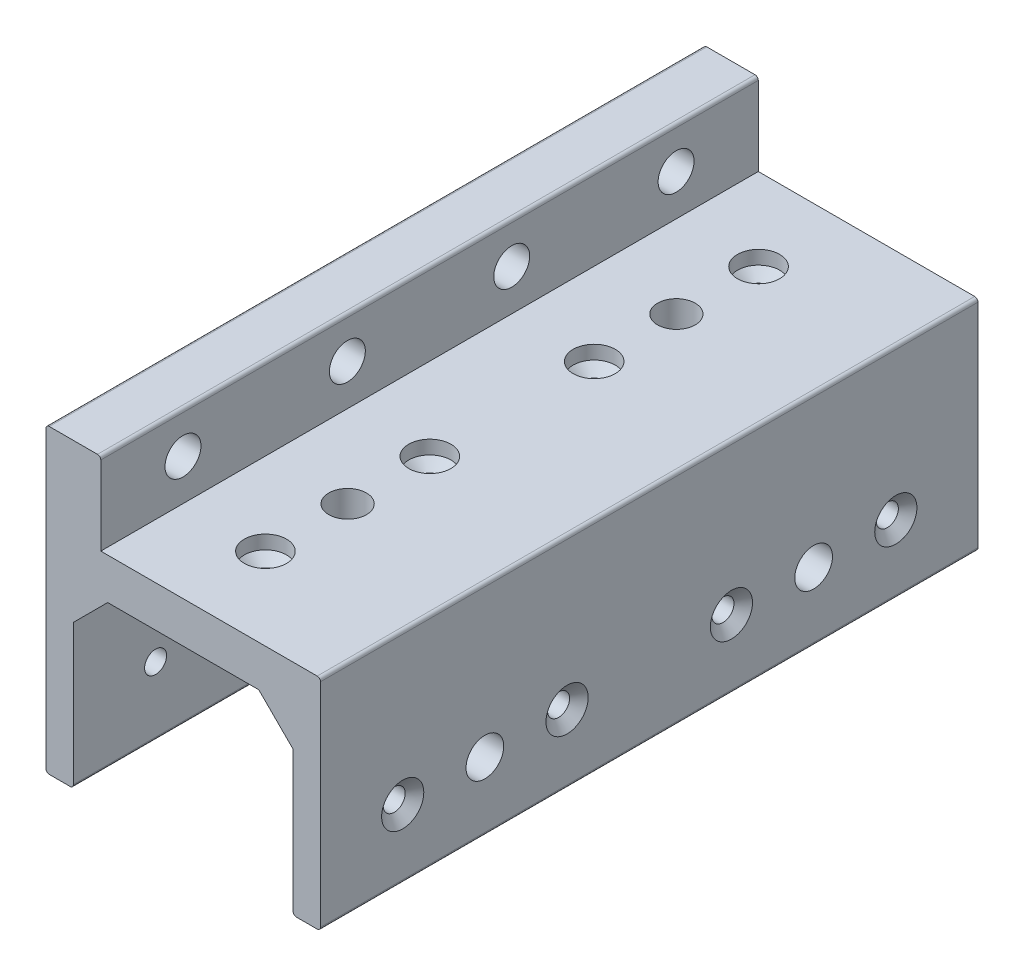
ISO-10303-21;
HEADER;
FILE_DESCRIPTION(('STEP AP214'),'2;1');
FILE_NAME('part.step','',(''),(''),'','','');
FILE_SCHEMA(('AUTOMOTIVE_DESIGN { 1 0 10303 214 1 1 1 1 }'));
ENDSEC;
DATA;
#1=APPLICATION_CONTEXT('core data for automotive mechanical design processes');
#2=APPLICATION_PROTOCOL_DEFINITION('international standard','automotive_design',2000,#1);
#3=PRODUCT_CONTEXT('',#1,'mechanical');
#4=PRODUCT('Part','Part','',(#3));
#5=PRODUCT_RELATED_PRODUCT_CATEGORY('part','',(#4));
#6=PRODUCT_DEFINITION_FORMATION('','',#4);
#7=PRODUCT_DEFINITION_CONTEXT('part definition',#1,'design');
#8=PRODUCT_DEFINITION('design','',#6,#7);
#9=PRODUCT_DEFINITION_SHAPE('','',#8);
#10=(LENGTH_UNIT() NAMED_UNIT(*) SI_UNIT(.MILLI.,.METRE.));
#11=(NAMED_UNIT(*) PLANE_ANGLE_UNIT() SI_UNIT($,.RADIAN.));
#12=(NAMED_UNIT(*) SI_UNIT($,.STERADIAN.) SOLID_ANGLE_UNIT());
#13=UNCERTAINTY_MEASURE_WITH_UNIT(LENGTH_MEASURE(1.E-05),#10,'distance_accuracy_value','');
#14=(GEOMETRIC_REPRESENTATION_CONTEXT(3) GLOBAL_UNCERTAINTY_ASSIGNED_CONTEXT((#13)) GLOBAL_UNIT_ASSIGNED_CONTEXT((#10,
#11,#12)) REPRESENTATION_CONTEXT('',''));
#15=CARTESIAN_POINT('',(0.,0.,0.));
#16=DIRECTION('',(0.,0.,1.));
#17=DIRECTION('',(1.,0.,0.));
#18=AXIS2_PLACEMENT_3D('',#15,#16,#17);
#19=CARTESIAN_POINT('',(102.521606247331,46.2370957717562,38.1));
#20=DIRECTION('',(0.,0.,-1.));
#21=DIRECTION('',(-1.,0.,0.));
#22=AXIS2_PLACEMENT_3D('',#19,#20,#21);
#23=CYLINDRICAL_SURFACE('',#22,0.761999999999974);
#24=DIRECTION('',(0.,0.,-1.));
#25=VECTOR('',#24,1.);
#26=CARTESIAN_POINT('',(101.759606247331,46.2370957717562,38.1));
#27=LINE('',#26,#25);
#28=CARTESIAN_POINT('',(101.759606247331,46.2370957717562,38.1));
#29=VERTEX_POINT('',#28);
#30=CARTESIAN_POINT('',(101.759606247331,46.2370957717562,-114.3));
#31=VERTEX_POINT('',#30);
#32=EDGE_CURVE('E165',#29,#31,#27,.T.);
#33=ORIENTED_EDGE('',*,*,#32,.T.);
#34=CARTESIAN_POINT('',(102.521606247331,46.2370957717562,-114.3));
#35=DIRECTION('',(0.,0.,1.));
#36=DIRECTION('',(1.,0.,0.));
#37=AXIS2_PLACEMENT_3D('',#34,#35,#36);
#38=CIRCLE('',#37,0.761999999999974);
#39=CARTESIAN_POINT('',(102.52160624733,45.4750957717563,-114.3));
#40=VERTEX_POINT('',#39);
#41=EDGE_CURVE('E160',#31,#40,#38,.T.);
#42=ORIENTED_EDGE('',*,*,#41,.T.);
#43=DIRECTION('',(0.,0.,-1.));
#44=VECTOR('',#43,1.);
#45=CARTESIAN_POINT('',(102.52160624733,45.4750957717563,38.1));
#46=LINE('',#45,#44);
#47=CARTESIAN_POINT('',(102.52160624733,45.4750957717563,38.1));
#48=VERTEX_POINT('',#47);
#49=EDGE_CURVE('E10',#48,#40,#46,.T.);
#50=ORIENTED_EDGE('',*,*,#49,.F.);
#51=CARTESIAN_POINT('',(102.521606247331,46.2370957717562,38.1));
#52=DIRECTION('',(0.,0.,1.));
#53=DIRECTION('',(1.,0.,0.));
#54=AXIS2_PLACEMENT_3D('',#51,#52,#53);
#55=CIRCLE('',#54,0.761999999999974);
#56=EDGE_CURVE('E298',#29,#48,#55,.T.);
#57=ORIENTED_EDGE('',*,*,#56,.F.);
#58=EDGE_LOOP('',(#33,#42,#50,#57));
#59=FACE_BOUND('',#58,.T.);
#60=ADVANCED_FACE('F16',(#59),#23,.T.);
#61=CARTESIAN_POINT('',(102.52160624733,45.4750957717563,38.1));
#62=DIRECTION('',(0.,1.,0.));
#63=DIRECTION('',(0.,0.,1.));
#64=AXIS2_PLACEMENT_3D('',#61,#62,#63);
#65=PLANE('',#64);
#66=ORIENTED_EDGE('',*,*,#49,.T.);
#67=DIRECTION('',(1.,0.,0.));
#68=VECTOR('',#67,1.);
#69=CARTESIAN_POINT('',(102.52160624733,45.4750957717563,-114.3));
#70=LINE('',#69,#68);
#71=CARTESIAN_POINT('',(107.34760624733,45.4750957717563,-114.3));
#72=VERTEX_POINT('',#71);
#73=EDGE_CURVE('E150',#40,#72,#70,.T.);
#74=ORIENTED_EDGE('',*,*,#73,.T.);
#75=DIRECTION('',(0.,0.,-1.));
#76=VECTOR('',#75,1.);
#77=CARTESIAN_POINT('',(107.34760624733,45.4750957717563,38.1));
#78=LINE('',#77,#76);
#79=CARTESIAN_POINT('',(107.34760624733,45.4750957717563,38.1));
#80=VERTEX_POINT('',#79);
#81=EDGE_CURVE('E24',#80,#72,#78,.T.);
#82=ORIENTED_EDGE('',*,*,#81,.F.);
#83=DIRECTION('',(1.,0.,0.));
#84=VECTOR('',#83,1.);
#85=CARTESIAN_POINT('',(102.52160624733,45.4750957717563,38.1));
#86=LINE('',#85,#84);
#87=EDGE_CURVE('E151',#48,#80,#86,.T.);
#88=ORIENTED_EDGE('',*,*,#87,.F.);
#89=EDGE_LOOP('',(#66,#74,#82,#88));
#90=FACE_BOUND('',#89,.T.);
#91=ADVANCED_FACE('F148',(#90),#65,.F.);
#92=CARTESIAN_POINT('',(107.347606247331,46.2370957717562,38.1));
#93=DIRECTION('',(0.,0.,-1.));
#94=DIRECTION('',(-1.,0.,0.));
#95=AXIS2_PLACEMENT_3D('',#92,#93,#94);
#96=CYLINDRICAL_SURFACE('',#95,0.761999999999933);
#97=ORIENTED_EDGE('',*,*,#81,.T.);
#98=CARTESIAN_POINT('',(107.347606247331,46.2370957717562,-114.3));
#99=DIRECTION('',(0.,0.,1.));
#100=DIRECTION('',(1.,0.,0.));
#101=AXIS2_PLACEMENT_3D('',#98,#99,#100);
#102=CIRCLE('',#101,0.761999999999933);
#103=CARTESIAN_POINT('',(108.109606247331,46.2370957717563,-114.3));
#104=VERTEX_POINT('',#103);
#105=EDGE_CURVE('E163',#72,#104,#102,.T.);
#106=ORIENTED_EDGE('',*,*,#105,.T.);
#107=DIRECTION('',(0.,0.,-1.));
#108=VECTOR('',#107,1.);
#109=CARTESIAN_POINT('',(108.109606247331,46.2370957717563,38.1));
#110=LINE('',#109,#108);
#111=CARTESIAN_POINT('',(108.109606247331,46.2370957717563,38.1));
#112=VERTEX_POINT('',#111);
#113=EDGE_CURVE('E364',#112,#104,#110,.T.);
#114=ORIENTED_EDGE('',*,*,#113,.F.);
#115=CARTESIAN_POINT('',(107.347606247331,46.2370957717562,38.1));
#116=DIRECTION('',(0.,0.,1.));
#117=DIRECTION('',(1.,0.,0.));
#118=AXIS2_PLACEMENT_3D('',#115,#116,#117);
#119=CIRCLE('',#118,0.761999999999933);
#120=EDGE_CURVE('E301',#80,#112,#119,.T.);
#121=ORIENTED_EDGE('',*,*,#120,.F.);
#122=EDGE_LOOP('',(#97,#106,#114,#121));
#123=FACE_BOUND('',#122,.T.);
#124=ADVANCED_FACE('F492',(#123),#96,.T.);
#125=CARTESIAN_POINT('',(108.109606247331,46.2370957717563,38.1));
#126=DIRECTION('',(-1.,0.,0.));
#127=DIRECTION('',(0.,-1.,0.));
#128=AXIS2_PLACEMENT_3D('',#125,#126,#127);
#129=PLANE('',#128);
#130=CARTESIAN_POINT('',(108.109606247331,61.3500957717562,-76.2));
#131=DIRECTION('',(1.,0.,0.));
#132=DIRECTION('',(0.,1.,0.));
#133=AXIS2_PLACEMENT_3D('',#130,#131,#132);
#134=CIRCLE('',#133,4.36880000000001);
#135=CARTESIAN_POINT('',(108.10960624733,65.7188957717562,-76.2));
#136=VERTEX_POINT('',#135);
#137=EDGE_CURVE('E382',#136,#136,#134,.T.);
#138=ORIENTED_EDGE('',*,*,#137,.F.);
#139=EDGE_LOOP('',(#138));
#140=FACE_BOUND('',#139,.T.);
#141=CARTESIAN_POINT('',(108.109606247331,61.3500957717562,0.));
#142=DIRECTION('',(1.,0.,0.));
#143=DIRECTION('',(0.,1.,0.));
#144=AXIS2_PLACEMENT_3D('',#141,#142,#143);
#145=CIRCLE('',#144,4.3688);
#146=CARTESIAN_POINT('',(108.10960624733,65.7188957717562,0.));
#147=VERTEX_POINT('',#146);
#148=EDGE_CURVE('E400',#147,#147,#145,.T.);
#149=ORIENTED_EDGE('',*,*,#148,.F.);
#150=EDGE_LOOP('',(#149));
#151=FACE_BOUND('',#150,.T.);
#152=CARTESIAN_POINT('',(108.109606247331,61.3500957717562,19.05));
#153=DIRECTION('',(1.,0.,0.));
#154=DIRECTION('',(0.,0.,-1.));
#155=AXIS2_PLACEMENT_3D('',#152,#153,#154);
#156=CIRCLE('',#155,4.8895);
#157=CARTESIAN_POINT('',(108.109606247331,61.3500957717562,14.1605));
#158=VERTEX_POINT('',#157);
#159=EDGE_CURVE('E291',#158,#158,#156,.T.);
#160=ORIENTED_EDGE('',*,*,#159,.F.);
#161=EDGE_LOOP('',(#160));
#162=FACE_BOUND('',#161,.T.);
#163=ORIENTED_EDGE('',*,*,#113,.T.);
#164=DIRECTION('',(0.,1.,0.));
#165=VECTOR('',#164,1.);
#166=CARTESIAN_POINT('',(108.109606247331,46.2370957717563,-114.3));
#167=LINE('',#166,#165);
#168=CARTESIAN_POINT('',(108.10960624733,95.5130957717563,-114.3));
#169=VERTEX_POINT('',#168);
#170=EDGE_CURVE('E175',#104,#169,#167,.T.);
#171=ORIENTED_EDGE('',*,*,#170,.T.);
#172=DIRECTION('',(0.,0.,-1.));
#173=VECTOR('',#172,1.);
#174=CARTESIAN_POINT('',(108.10960624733,95.5130957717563,38.1));
#175=LINE('',#174,#173);
#176=CARTESIAN_POINT('',(108.10960624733,95.5130957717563,38.1));
#177=VERTEX_POINT('',#176);
#178=EDGE_CURVE('E362',#177,#169,#175,.T.);
#179=ORIENTED_EDGE('',*,*,#178,.F.);
#180=DIRECTION('',(0.,1.,0.));
#181=VECTOR('',#180,1.);
#182=CARTESIAN_POINT('',(108.109606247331,46.2370957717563,38.1));
#183=LINE('',#182,#181);
#184=EDGE_CURVE('E303',#112,#177,#183,.T.);
#185=ORIENTED_EDGE('',*,*,#184,.F.);
#186=EDGE_LOOP('',(#163,#171,#179,#185));
#187=FACE_BOUND('',#186,.T.);
#188=CARTESIAN_POINT('',(108.109606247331,61.3500957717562,-19.05));
#189=DIRECTION('',(-1.,0.,0.));
#190=DIRECTION('',(0.,0.,1.));
#191=AXIS2_PLACEMENT_3D('',#188,#189,#190);
#192=CIRCLE('',#191,4.8895);
#193=CARTESIAN_POINT('',(108.109606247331,61.3500957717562,-14.1605));
#194=VERTEX_POINT('',#193);
#195=EDGE_CURVE('E255',#194,#194,#192,.T.);
#196=ORIENTED_EDGE('',*,*,#195,.T.);
#197=EDGE_LOOP('',(#196));
#198=FACE_BOUND('',#197,.T.);
#199=CARTESIAN_POINT('',(108.109606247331,61.3500957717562,-95.25));
#200=DIRECTION('',(-1.,0.,0.));
#201=DIRECTION('',(0.,0.,1.));
#202=AXIS2_PLACEMENT_3D('',#199,#200,#201);
#203=CIRCLE('',#202,4.8895);
#204=CARTESIAN_POINT('',(108.109606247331,61.3500957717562,-90.3605));
#205=VERTEX_POINT('',#204);
#206=EDGE_CURVE('E225',#205,#205,#203,.T.);
#207=ORIENTED_EDGE('',*,*,#206,.T.);
#208=EDGE_LOOP('',(#207));
#209=FACE_BOUND('',#208,.T.);
#210=CARTESIAN_POINT('',(108.109606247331,61.3500957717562,-57.15));
#211=DIRECTION('',(1.,0.,0.));
#212=DIRECTION('',(0.,0.,-1.));
#213=AXIS2_PLACEMENT_3D('',#210,#211,#212);
#214=CIRCLE('',#213,4.8895);
#215=CARTESIAN_POINT('',(108.109606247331,61.3500957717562,-62.0395));
#216=VERTEX_POINT('',#215);
#217=EDGE_CURVE('E432',#216,#216,#214,.T.);
#218=ORIENTED_EDGE('',*,*,#217,.F.);
#219=EDGE_LOOP('',(#218));
#220=FACE_BOUND('',#219,.T.);
#221=ADVANCED_FACE('F467',(#140,#151,#162,#187,#198,#209,#220),#129,.F.);
#222=CARTESIAN_POINT('',(107.347606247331,95.5130957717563,38.1));
#223=DIRECTION('',(0.,0.,-1.));
#224=DIRECTION('',(-1.,0.,0.));
#225=AXIS2_PLACEMENT_3D('',#222,#223,#224);
#226=CYLINDRICAL_SURFACE('',#225,0.761999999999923);
#227=ORIENTED_EDGE('',*,*,#178,.T.);
#228=CARTESIAN_POINT('',(107.347606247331,95.5130957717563,-114.3));
#229=DIRECTION('',(0.,0.,1.));
#230=DIRECTION('',(1.,0.,0.));
#231=AXIS2_PLACEMENT_3D('',#228,#229,#230);
#232=CIRCLE('',#231,0.761999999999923);
#233=CARTESIAN_POINT('',(107.347606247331,96.2750957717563,-114.3));
#234=VERTEX_POINT('',#233);
#235=EDGE_CURVE('E178',#169,#234,#232,.T.);
#236=ORIENTED_EDGE('',*,*,#235,.T.);
#237=DIRECTION('',(0.,0.,-1.));
#238=VECTOR('',#237,1.);
#239=CARTESIAN_POINT('',(107.347606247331,96.2750957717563,38.1));
#240=LINE('',#239,#238);
#241=CARTESIAN_POINT('',(107.347606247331,96.2750957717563,38.1));
#242=VERTEX_POINT('',#241);
#243=EDGE_CURVE('E360',#242,#234,#240,.T.);
#244=ORIENTED_EDGE('',*,*,#243,.F.);
#245=CARTESIAN_POINT('',(107.347606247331,95.5130957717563,38.1));
#246=DIRECTION('',(0.,0.,1.));
#247=DIRECTION('',(1.,0.,0.));
#248=AXIS2_PLACEMENT_3D('',#245,#246,#247);
#249=CIRCLE('',#248,0.761999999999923);
#250=EDGE_CURVE('E305',#177,#242,#249,.T.);
#251=ORIENTED_EDGE('',*,*,#250,.F.);
#252=EDGE_LOOP('',(#227,#236,#244,#251));
#253=FACE_BOUND('',#252,.T.);
#254=ADVANCED_FACE('F502',(#253),#226,.T.);
#255=CARTESIAN_POINT('',(107.347606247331,96.2750957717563,38.1));
#256=DIRECTION('',(0.,-1.,0.));
#257=DIRECTION('',(1.,0.,0.));
#258=AXIS2_PLACEMENT_3D('',#255,#256,#257);
#259=PLANE('',#258);
#260=CARTESIAN_POINT('',(76.2961062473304,96.2750957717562,-76.2));
#261=DIRECTION('',(0.,1.,0.));
#262=DIRECTION('',(-1.,0.,0.));
#263=AXIS2_PLACEMENT_3D('',#260,#261,#262);
#264=CIRCLE('',#263,4.36880000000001);
#265=CARTESIAN_POINT('',(71.9273062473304,96.2750957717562,-76.2));
#266=VERTEX_POINT('',#265);
#267=EDGE_CURVE('E393',#266,#266,#264,.T.);
#268=ORIENTED_EDGE('',*,*,#267,.F.);
#269=EDGE_LOOP('',(#268));
#270=FACE_BOUND('',#269,.T.);
#271=CARTESIAN_POINT('',(76.2961062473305,96.2750957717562,0.));
#272=DIRECTION('',(0.,1.,0.));
#273=DIRECTION('',(-1.,0.,0.));
#274=AXIS2_PLACEMENT_3D('',#271,#272,#273);
#275=CIRCLE('',#274,4.36880000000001);
#276=CARTESIAN_POINT('',(71.9273062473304,96.2750957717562,0.));
#277=VERTEX_POINT('',#276);
#278=EDGE_CURVE('E383',#277,#277,#275,.T.);
#279=ORIENTED_EDGE('',*,*,#278,.F.);
#280=EDGE_LOOP('',(#279));
#281=FACE_BOUND('',#280,.T.);
#282=CARTESIAN_POINT('',(76.2961062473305,96.2750957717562,19.05));
#283=DIRECTION('',(0.,1.,0.));
#284=DIRECTION('',(0.,0.,1.));
#285=AXIS2_PLACEMENT_3D('',#282,#283,#284);
#286=CIRCLE('',#285,4.88950000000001);
#287=CARTESIAN_POINT('',(76.2961062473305,96.2750957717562,23.9395));
#288=VERTEX_POINT('',#287);
#289=EDGE_CURVE('E272',#288,#288,#286,.T.);
#290=ORIENTED_EDGE('',*,*,#289,.F.);
#291=EDGE_LOOP('',(#290));
#292=FACE_BOUND('',#291,.T.);
#293=ORIENTED_EDGE('',*,*,#243,.T.);
#294=DIRECTION('',(-1.,0.,0.));
#295=VECTOR('',#294,1.);
#296=CARTESIAN_POINT('',(107.347606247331,96.2750957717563,-114.3));
#297=LINE('',#296,#295);
#298=CARTESIAN_POINT('',(57.1826062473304,96.2750957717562,-114.3));
#299=VERTEX_POINT('',#298);
#300=EDGE_CURVE('E181',#234,#299,#297,.T.);
#301=ORIENTED_EDGE('',*,*,#300,.T.);
#302=DIRECTION('',(0.,0.,-1.));
#303=VECTOR('',#302,1.);
#304=CARTESIAN_POINT('',(57.1826062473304,96.2750957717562,38.1));
#305=LINE('',#304,#303);
#306=CARTESIAN_POINT('',(57.1826062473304,96.2750957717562,38.1));
#307=VERTEX_POINT('',#306);
#308=EDGE_CURVE('E358',#307,#299,#305,.T.);
#309=ORIENTED_EDGE('',*,*,#308,.F.);
#310=DIRECTION('',(-1.,0.,0.));
#311=VECTOR('',#310,1.);
#312=CARTESIAN_POINT('',(107.347606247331,96.2750957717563,38.1));
#313=LINE('',#312,#311);
#314=EDGE_CURVE('E307',#242,#307,#313,.T.);
#315=ORIENTED_EDGE('',*,*,#314,.F.);
#316=EDGE_LOOP('',(#293,#301,#309,#315));
#317=FACE_BOUND('',#316,.T.);
#318=CARTESIAN_POINT('',(76.2961062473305,96.2750957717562,-19.05));
#319=DIRECTION('',(0.,-1.,0.));
#320=DIRECTION('',(0.,0.,-1.));
#321=AXIS2_PLACEMENT_3D('',#318,#319,#320);
#322=CIRCLE('',#321,4.88950000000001);
#323=CARTESIAN_POINT('',(76.2961062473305,96.2750957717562,-23.9395));
#324=VERTEX_POINT('',#323);
#325=EDGE_CURVE('E236',#324,#324,#322,.T.);
#326=ORIENTED_EDGE('',*,*,#325,.T.);
#327=EDGE_LOOP('',(#326));
#328=FACE_BOUND('',#327,.T.);
#329=CARTESIAN_POINT('',(76.2961062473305,96.2750957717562,-95.25));
#330=DIRECTION('',(0.,-1.,0.));
#331=DIRECTION('',(0.,0.,-1.));
#332=AXIS2_PLACEMENT_3D('',#329,#330,#331);
#333=CIRCLE('',#332,4.88950000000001);
#334=CARTESIAN_POINT('',(76.2961062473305,96.2750957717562,-100.1395));
#335=VERTEX_POINT('',#334);
#336=EDGE_CURVE('E230',#335,#335,#333,.T.);
#337=ORIENTED_EDGE('',*,*,#336,.T.);
#338=EDGE_LOOP('',(#337));
#339=FACE_BOUND('',#338,.T.);
#340=CARTESIAN_POINT('',(76.2961062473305,96.2750957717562,-57.15));
#341=DIRECTION('',(0.,1.,0.));
#342=DIRECTION('',(0.,0.,1.));
#343=AXIS2_PLACEMENT_3D('',#340,#341,#342);
#344=CIRCLE('',#343,4.88950000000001);
#345=CARTESIAN_POINT('',(76.2961062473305,96.2750957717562,-52.2605));
#346=VERTEX_POINT('',#345);
#347=EDGE_CURVE('E413',#346,#346,#344,.T.);
#348=ORIENTED_EDGE('',*,*,#347,.F.);
#349=EDGE_LOOP('',(#348));
#350=FACE_BOUND('',#349,.T.);
#351=ADVANCED_FACE('F506',(#270,#281,#292,#317,#328,#339,#350),#259,.F.);
#352=CARTESIAN_POINT('',(57.1826062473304,96.2750957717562,38.1));
#353=DIRECTION('',(-1.,0.,0.));
#354=DIRECTION('',(0.,-1.,0.));
#355=AXIS2_PLACEMENT_3D('',#352,#353,#354);
#356=PLANE('',#355);
#357=CARTESIAN_POINT('',(57.1826062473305,105.800095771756,19.05));
#358=DIRECTION('',(1.,0.,0.));
#359=DIRECTION('',(0.,1.,0.));
#360=AXIS2_PLACEMENT_3D('',#357,#358,#359);
#361=CIRCLE('',#360,4.1656);
#362=CARTESIAN_POINT('',(57.1826062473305,109.965695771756,19.05));
#363=VERTEX_POINT('',#362);
#364=EDGE_CURVE('E282',#363,#363,#361,.T.);
#365=ORIENTED_EDGE('',*,*,#364,.F.);
#366=EDGE_LOOP('',(#365));
#367=FACE_BOUND('',#366,.T.);
#368=ORIENTED_EDGE('',*,*,#308,.T.);
#369=DIRECTION('',(0.,1.,0.));
#370=VECTOR('',#369,1.);
#371=CARTESIAN_POINT('',(57.1826062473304,96.2750957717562,-114.3));
#372=LINE('',#371,#370);
#373=CARTESIAN_POINT('',(57.1826062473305,114.563095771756,-114.3));
#374=VERTEX_POINT('',#373);
#375=EDGE_CURVE('E184',#299,#374,#372,.T.);
#376=ORIENTED_EDGE('',*,*,#375,.T.);
#377=DIRECTION('',(0.,0.,-1.));
#378=VECTOR('',#377,1.);
#379=CARTESIAN_POINT('',(57.1826062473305,114.563095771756,38.1));
#380=LINE('',#379,#378);
#381=CARTESIAN_POINT('',(57.1826062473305,114.563095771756,38.1));
#382=VERTEX_POINT('',#381);
#383=EDGE_CURVE('E356',#382,#374,#380,.T.);
#384=ORIENTED_EDGE('',*,*,#383,.F.);
#385=DIRECTION('',(0.,1.,0.));
#386=VECTOR('',#385,1.);
#387=CARTESIAN_POINT('',(57.1826062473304,96.2750957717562,38.1));
#388=LINE('',#387,#386);
#389=EDGE_CURVE('E309',#307,#382,#388,.T.);
#390=ORIENTED_EDGE('',*,*,#389,.F.);
#391=EDGE_LOOP('',(#368,#376,#384,#390));
#392=FACE_BOUND('',#391,.T.);
#393=CARTESIAN_POINT('',(57.1826062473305,105.800095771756,-19.05));
#394=DIRECTION('',(-1.,0.,0.));
#395=DIRECTION('',(0.,1.,0.));
#396=AXIS2_PLACEMENT_3D('',#393,#394,#395);
#397=CIRCLE('',#396,4.1656);
#398=CARTESIAN_POINT('',(57.1826062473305,109.965695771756,-19.05));
#399=VERTEX_POINT('',#398);
#400=EDGE_CURVE('E246',#399,#399,#397,.T.);
#401=ORIENTED_EDGE('',*,*,#400,.T.);
#402=EDGE_LOOP('',(#401));
#403=FACE_BOUND('',#402,.T.);
#404=CARTESIAN_POINT('',(57.1826062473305,105.800095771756,-95.25));
#405=DIRECTION('',(-1.,0.,0.));
#406=DIRECTION('',(0.,1.,0.));
#407=AXIS2_PLACEMENT_3D('',#404,#405,#406);
#408=CIRCLE('',#407,4.1656);
#409=CARTESIAN_POINT('',(57.1826062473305,109.965695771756,-95.25));
#410=VERTEX_POINT('',#409);
#411=EDGE_CURVE('E456',#410,#410,#408,.T.);
#412=ORIENTED_EDGE('',*,*,#411,.T.);
#413=EDGE_LOOP('',(#412));
#414=FACE_BOUND('',#413,.T.);
#415=CARTESIAN_POINT('',(57.1826062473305,105.800095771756,-57.15));
#416=DIRECTION('',(1.,0.,0.));
#417=DIRECTION('',(0.,1.,0.));
#418=AXIS2_PLACEMENT_3D('',#415,#416,#417);
#419=CIRCLE('',#418,4.1656);
#420=CARTESIAN_POINT('',(57.1826062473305,109.965695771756,-57.15));
#421=VERTEX_POINT('',#420);
#422=EDGE_CURVE('E423',#421,#421,#419,.T.);
#423=ORIENTED_EDGE('',*,*,#422,.F.);
#424=EDGE_LOOP('',(#423));
#425=FACE_BOUND('',#424,.T.);
#426=ADVANCED_FACE('F510',(#367,#392,#403,#414,#425),#356,.F.);
#427=CARTESIAN_POINT('',(56.4206062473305,114.563095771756,38.1));
#428=DIRECTION('',(0.,0.,-1.));
#429=DIRECTION('',(-1.,0.,0.));
#430=AXIS2_PLACEMENT_3D('',#427,#428,#429);
#431=CYLINDRICAL_SURFACE('',#430,0.762000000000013);
#432=ORIENTED_EDGE('',*,*,#383,.T.);
#433=CARTESIAN_POINT('',(56.4206062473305,114.563095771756,-114.3));
#434=DIRECTION('',(0.,0.,1.));
#435=DIRECTION('',(1.,0.,0.));
#436=AXIS2_PLACEMENT_3D('',#433,#434,#435);
#437=CIRCLE('',#436,0.762000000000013);
#438=CARTESIAN_POINT('',(56.4206062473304,115.325095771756,-114.3));
#439=VERTEX_POINT('',#438);
#440=EDGE_CURVE('E187',#374,#439,#437,.T.);
#441=ORIENTED_EDGE('',*,*,#440,.T.);
#442=DIRECTION('',(0.,0.,-1.));
#443=VECTOR('',#442,1.);
#444=CARTESIAN_POINT('',(56.4206062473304,115.325095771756,38.1));
#445=LINE('',#444,#443);
#446=CARTESIAN_POINT('',(56.4206062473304,115.325095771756,38.1));
#447=VERTEX_POINT('',#446);
#448=EDGE_CURVE('E354',#447,#439,#445,.T.);
#449=ORIENTED_EDGE('',*,*,#448,.F.);
#450=CARTESIAN_POINT('',(56.4206062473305,114.563095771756,38.1));
#451=DIRECTION('',(0.,0.,1.));
#452=DIRECTION('',(1.,0.,0.));
#453=AXIS2_PLACEMENT_3D('',#450,#451,#452);
#454=CIRCLE('',#453,0.762000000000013);
#455=EDGE_CURVE('E311',#382,#447,#454,.T.);
#456=ORIENTED_EDGE('',*,*,#455,.F.);
#457=EDGE_LOOP('',(#432,#441,#449,#456));
#458=FACE_BOUND('',#457,.T.);
#459=ADVANCED_FACE('F514',(#458),#431,.T.);
#460=CARTESIAN_POINT('',(56.4206062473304,115.325095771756,38.1));
#461=DIRECTION('',(0.,-1.,0.));
#462=DIRECTION('',(0.,0.,-1.));
#463=AXIS2_PLACEMENT_3D('',#460,#461,#462);
#464=PLANE('',#463);
#465=ORIENTED_EDGE('',*,*,#448,.T.);
#466=DIRECTION('',(-1.,0.,0.));
#467=VECTOR('',#466,1.);
#468=CARTESIAN_POINT('',(56.4206062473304,115.325095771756,-114.3));
#469=LINE('',#468,#467);
#470=CARTESIAN_POINT('',(45.2446062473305,115.325095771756,-114.3));
#471=VERTEX_POINT('',#470);
#472=EDGE_CURVE('E190',#439,#471,#469,.T.);
#473=ORIENTED_EDGE('',*,*,#472,.T.);
#474=DIRECTION('',(0.,0.,-1.));
#475=VECTOR('',#474,1.);
#476=CARTESIAN_POINT('',(45.2446062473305,115.325095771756,38.1));
#477=LINE('',#476,#475);
#478=CARTESIAN_POINT('',(45.2446062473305,115.325095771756,38.1));
#479=VERTEX_POINT('',#478);
#480=EDGE_CURVE('E352',#479,#471,#477,.T.);
#481=ORIENTED_EDGE('',*,*,#480,.F.);
#482=DIRECTION('',(-1.,0.,0.));
#483=VECTOR('',#482,1.);
#484=CARTESIAN_POINT('',(56.4206062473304,115.325095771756,38.1));
#485=LINE('',#484,#483);
#486=EDGE_CURVE('E313',#447,#479,#485,.T.);
#487=ORIENTED_EDGE('',*,*,#486,.F.);
#488=EDGE_LOOP('',(#465,#473,#481,#487));
#489=FACE_BOUND('',#488,.T.);
#490=ADVANCED_FACE('F518',(#489),#464,.F.);
#491=CARTESIAN_POINT('',(45.2446062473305,114.563095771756,38.1));
#492=DIRECTION('',(0.,0.,-1.));
#493=DIRECTION('',(-1.,0.,0.));
#494=AXIS2_PLACEMENT_3D('',#491,#492,#493);
#495=CYLINDRICAL_SURFACE('',#494,0.762000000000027);
#496=ORIENTED_EDGE('',*,*,#480,.T.);
#497=CARTESIAN_POINT('',(45.2446062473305,114.563095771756,-114.3));
#498=DIRECTION('',(0.,0.,1.));
#499=DIRECTION('',(1.,0.,0.));
#500=AXIS2_PLACEMENT_3D('',#497,#498,#499);
#501=CIRCLE('',#500,0.762000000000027);
#502=CARTESIAN_POINT('',(44.4826062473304,114.563095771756,-114.3));
#503=VERTEX_POINT('',#502);
#504=EDGE_CURVE('E193',#471,#503,#501,.T.);
#505=ORIENTED_EDGE('',*,*,#504,.T.);
#506=DIRECTION('',(0.,0.,-1.));
#507=VECTOR('',#506,1.);
#508=CARTESIAN_POINT('',(44.4826062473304,114.563095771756,38.1));
#509=LINE('',#508,#507);
#510=CARTESIAN_POINT('',(44.4826062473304,114.563095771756,38.1));
#511=VERTEX_POINT('',#510);
#512=EDGE_CURVE('E350',#511,#503,#509,.T.);
#513=ORIENTED_EDGE('',*,*,#512,.F.);
#514=CARTESIAN_POINT('',(45.2446062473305,114.563095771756,38.1));
#515=DIRECTION('',(0.,0.,1.));
#516=DIRECTION('',(1.,0.,0.));
#517=AXIS2_PLACEMENT_3D('',#514,#515,#516);
#518=CIRCLE('',#517,0.762000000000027);
#519=EDGE_CURVE('E315',#479,#511,#518,.T.);
#520=ORIENTED_EDGE('',*,*,#519,.F.);
#521=EDGE_LOOP('',(#496,#505,#513,#520));
#522=FACE_BOUND('',#521,.T.);
#523=ADVANCED_FACE('F522',(#522),#495,.T.);
#524=CARTESIAN_POINT('',(44.4826062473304,114.563095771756,38.1));
#525=DIRECTION('',(1.,0.,0.));
#526=DIRECTION('',(0.,1.,0.));
#527=AXIS2_PLACEMENT_3D('',#524,#525,#526);
#528=PLANE('',#527);
#529=CARTESIAN_POINT('',(44.4826062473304,61.3500957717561,-76.2));
#530=DIRECTION('',(1.,0.,0.));
#531=DIRECTION('',(0.,1.,0.));
#532=AXIS2_PLACEMENT_3D('',#529,#530,#531);
#533=CIRCLE('',#532,4.36880000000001);
#534=CARTESIAN_POINT('',(44.4826062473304,65.7188957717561,-76.2));
#535=VERTEX_POINT('',#534);
#536=EDGE_CURVE('E379',#535,#535,#533,.T.);
#537=ORIENTED_EDGE('',*,*,#536,.T.);
#538=EDGE_LOOP('',(#537));
#539=FACE_BOUND('',#538,.T.);
#540=CARTESIAN_POINT('',(44.4826062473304,61.3500957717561,0.));
#541=DIRECTION('',(1.,0.,0.));
#542=DIRECTION('',(0.,1.,0.));
#543=AXIS2_PLACEMENT_3D('',#540,#541,#542);
#544=CIRCLE('',#543,4.3688);
#545=CARTESIAN_POINT('',(44.4826062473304,65.7188957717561,0.));
#546=VERTEX_POINT('',#545);
#547=EDGE_CURVE('E375',#546,#546,#544,.T.);
#548=ORIENTED_EDGE('',*,*,#547,.T.);
#549=EDGE_LOOP('',(#548));
#550=FACE_BOUND('',#549,.T.);
#551=CARTESIAN_POINT('',(44.4826062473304,61.3500957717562,19.05));
#552=DIRECTION('',(-1.,0.,0.));
#553=DIRECTION('',(0.,0.,1.));
#554=AXIS2_PLACEMENT_3D('',#551,#552,#553);
#555=CIRCLE('',#554,4.8895);
#556=CARTESIAN_POINT('',(44.4826062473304,61.3500957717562,23.9395));
#557=VERTEX_POINT('',#556);
#558=EDGE_CURVE('E279',#557,#557,#555,.T.);
#559=ORIENTED_EDGE('',*,*,#558,.F.);
#560=EDGE_LOOP('',(#559));
#561=FACE_BOUND('',#560,.T.);
#562=CARTESIAN_POINT('',(44.4826062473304,105.800095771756,19.05));
#563=DIRECTION('',(1.,0.,0.));
#564=DIRECTION('',(0.,1.,0.));
#565=AXIS2_PLACEMENT_3D('',#562,#563,#564);
#566=CIRCLE('',#565,4.1656);
#567=CARTESIAN_POINT('',(44.4826062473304,109.965695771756,19.05));
#568=VERTEX_POINT('',#567);
#569=EDGE_CURVE('E283',#568,#568,#566,.T.);
#570=ORIENTED_EDGE('',*,*,#569,.T.);
#571=EDGE_LOOP('',(#570));
#572=FACE_BOUND('',#571,.T.);
#573=ORIENTED_EDGE('',*,*,#512,.T.);
#574=DIRECTION('',(0.,-1.,0.));
#575=VECTOR('',#574,1.);
#576=CARTESIAN_POINT('',(44.4826062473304,114.563095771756,-114.3));
#577=LINE('',#576,#575);
#578=CARTESIAN_POINT('',(44.4826062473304,46.2370957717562,-114.3));
#579=VERTEX_POINT('',#578);
#580=EDGE_CURVE('E196',#503,#579,#577,.T.);
#581=ORIENTED_EDGE('',*,*,#580,.T.);
#582=DIRECTION('',(0.,0.,-1.));
#583=VECTOR('',#582,1.);
#584=CARTESIAN_POINT('',(44.4826062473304,46.2370957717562,38.1));
#585=LINE('',#584,#583);
#586=CARTESIAN_POINT('',(44.4826062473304,46.2370957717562,38.1));
#587=VERTEX_POINT('',#586);
#588=EDGE_CURVE('E348',#587,#579,#585,.T.);
#589=ORIENTED_EDGE('',*,*,#588,.F.);
#590=DIRECTION('',(0.,-1.,0.));
#591=VECTOR('',#590,1.);
#592=CARTESIAN_POINT('',(44.4826062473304,114.563095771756,38.1));
#593=LINE('',#592,#591);
#594=EDGE_CURVE('E317',#511,#587,#593,.T.);
#595=ORIENTED_EDGE('',*,*,#594,.F.);
#596=EDGE_LOOP('',(#573,#581,#589,#595));
#597=FACE_BOUND('',#596,.T.);
#598=CARTESIAN_POINT('',(44.4826062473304,61.3500957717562,-19.05));
#599=DIRECTION('',(1.,0.,0.));
#600=DIRECTION('',(0.,0.,-1.));
#601=AXIS2_PLACEMENT_3D('',#598,#599,#600);
#602=CIRCLE('',#601,4.8895);
#603=CARTESIAN_POINT('',(44.4826062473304,61.3500957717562,-23.9395));
#604=VERTEX_POINT('',#603);
#605=EDGE_CURVE('E243',#604,#604,#602,.T.);
#606=ORIENTED_EDGE('',*,*,#605,.T.);
#607=EDGE_LOOP('',(#606));
#608=FACE_BOUND('',#607,.T.);
#609=CARTESIAN_POINT('',(44.4826062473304,105.800095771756,-19.05));
#610=DIRECTION('',(-1.,0.,0.));
#611=DIRECTION('',(0.,1.,0.));
#612=AXIS2_PLACEMENT_3D('',#609,#610,#611);
#613=CIRCLE('',#612,4.1656);
#614=CARTESIAN_POINT('',(44.4826062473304,109.965695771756,-19.05));
#615=VERTEX_POINT('',#614);
#616=EDGE_CURVE('E247',#615,#615,#613,.T.);
#617=ORIENTED_EDGE('',*,*,#616,.F.);
#618=EDGE_LOOP('',(#617));
#619=FACE_BOUND('',#618,.T.);
#620=CARTESIAN_POINT('',(44.4826062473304,61.3500957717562,-95.25));
#621=DIRECTION('',(1.,0.,0.));
#622=DIRECTION('',(0.,0.,-1.));
#623=AXIS2_PLACEMENT_3D('',#620,#621,#622);
#624=CIRCLE('',#623,4.8895);
#625=CARTESIAN_POINT('',(44.4826062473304,61.3500957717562,-100.1395));
#626=VERTEX_POINT('',#625);
#627=EDGE_CURVE('E453',#626,#626,#624,.T.);
#628=ORIENTED_EDGE('',*,*,#627,.T.);
#629=EDGE_LOOP('',(#628));
#630=FACE_BOUND('',#629,.T.);
#631=CARTESIAN_POINT('',(44.4826062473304,105.800095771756,-95.25));
#632=DIRECTION('',(-1.,0.,0.));
#633=DIRECTION('',(0.,1.,0.));
#634=AXIS2_PLACEMENT_3D('',#631,#632,#633);
#635=CIRCLE('',#634,4.1656);
#636=CARTESIAN_POINT('',(44.4826062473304,109.965695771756,-95.25));
#637=VERTEX_POINT('',#636);
#638=EDGE_CURVE('E457',#637,#637,#635,.T.);
#639=ORIENTED_EDGE('',*,*,#638,.F.);
#640=EDGE_LOOP('',(#639));
#641=FACE_BOUND('',#640,.T.);
#642=CARTESIAN_POINT('',(44.4826062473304,61.3500957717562,-57.15));
#643=DIRECTION('',(-1.,0.,0.));
#644=DIRECTION('',(0.,0.,1.));
#645=AXIS2_PLACEMENT_3D('',#642,#643,#644);
#646=CIRCLE('',#645,4.8895);
#647=CARTESIAN_POINT('',(44.4826062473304,61.3500957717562,-52.2605));
#648=VERTEX_POINT('',#647);
#649=EDGE_CURVE('E420',#648,#648,#646,.T.);
#650=ORIENTED_EDGE('',*,*,#649,.F.);
#651=EDGE_LOOP('',(#650));
#652=FACE_BOUND('',#651,.T.);
#653=CARTESIAN_POINT('',(44.4826062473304,105.800095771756,-57.15));
#654=DIRECTION('',(1.,0.,0.));
#655=DIRECTION('',(0.,1.,0.));
#656=AXIS2_PLACEMENT_3D('',#653,#654,#655);
#657=CIRCLE('',#656,4.1656);
#658=CARTESIAN_POINT('',(44.4826062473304,109.965695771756,-57.15));
#659=VERTEX_POINT('',#658);
#660=EDGE_CURVE('E424',#659,#659,#657,.T.);
#661=ORIENTED_EDGE('',*,*,#660,.T.);
#662=EDGE_LOOP('',(#661));
#663=FACE_BOUND('',#662,.T.);
#664=ADVANCED_FACE('F526',(#539,#550,#561,#572,#597,#608,#619,#630,#641,#652,#663),#528,.F.);
#665=CARTESIAN_POINT('',(45.2446062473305,46.2370957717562,38.1));
#666=DIRECTION('',(0.,0.,-1.));
#667=DIRECTION('',(-1.,0.,0.));
#668=AXIS2_PLACEMENT_3D('',#665,#666,#667);
#669=CYLINDRICAL_SURFACE('',#668,0.762000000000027);
#670=ORIENTED_EDGE('',*,*,#588,.T.);
#671=CARTESIAN_POINT('',(45.2446062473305,46.2370957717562,-114.3));
#672=DIRECTION('',(0.,0.,1.));
#673=DIRECTION('',(1.,0.,0.));
#674=AXIS2_PLACEMENT_3D('',#671,#672,#673);
#675=CIRCLE('',#674,0.762000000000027);
#676=CARTESIAN_POINT('',(45.2446062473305,45.4750957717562,-114.3));
#677=VERTEX_POINT('',#676);
#678=EDGE_CURVE('E199',#579,#677,#675,.T.);
#679=ORIENTED_EDGE('',*,*,#678,.T.);
#680=DIRECTION('',(0.,0.,-1.));
#681=VECTOR('',#680,1.);
#682=CARTESIAN_POINT('',(45.2446062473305,45.4750957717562,38.1));
#683=LINE('',#682,#681);
#684=CARTESIAN_POINT('',(45.2446062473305,45.4750957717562,38.1));
#685=VERTEX_POINT('',#684);
#686=EDGE_CURVE('E346',#685,#677,#683,.T.);
#687=ORIENTED_EDGE('',*,*,#686,.F.);
#688=CARTESIAN_POINT('',(45.2446062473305,46.2370957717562,38.1));
#689=DIRECTION('',(0.,0.,1.));
#690=DIRECTION('',(1.,0.,0.));
#691=AXIS2_PLACEMENT_3D('',#688,#689,#690);
#692=CIRCLE('',#691,0.762000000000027);
#693=EDGE_CURVE('E319',#587,#685,#692,.T.);
#694=ORIENTED_EDGE('',*,*,#693,.F.);
#695=EDGE_LOOP('',(#670,#679,#687,#694));
#696=FACE_BOUND('',#695,.T.);
#697=ADVANCED_FACE('F530',(#696),#669,.T.);
#698=CARTESIAN_POINT('',(45.2446062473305,45.4750957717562,38.1));
#699=DIRECTION('',(0.,1.,0.));
#700=DIRECTION('',(0.,0.,1.));
#701=AXIS2_PLACEMENT_3D('',#698,#699,#700);
#702=PLANE('',#701);
#703=ORIENTED_EDGE('',*,*,#686,.T.);
#704=DIRECTION('',(1.,0.,0.));
#705=VECTOR('',#704,1.);
#706=CARTESIAN_POINT('',(45.2446062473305,45.4750957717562,-114.3));
#707=LINE('',#706,#705);
#708=CARTESIAN_POINT('',(50.0706062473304,45.4750957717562,-114.3));
#709=VERTEX_POINT('',#708);
#710=EDGE_CURVE('E202',#677,#709,#707,.T.);
#711=ORIENTED_EDGE('',*,*,#710,.T.);
#712=DIRECTION('',(0.,0.,-1.));
#713=VECTOR('',#712,1.);
#714=CARTESIAN_POINT('',(50.0706062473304,45.4750957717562,38.1));
#715=LINE('',#714,#713);
#716=CARTESIAN_POINT('',(50.0706062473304,45.4750957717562,38.1));
#717=VERTEX_POINT('',#716);
#718=EDGE_CURVE('E344',#717,#709,#715,.T.);
#719=ORIENTED_EDGE('',*,*,#718,.F.);
#720=DIRECTION('',(1.,0.,0.));
#721=VECTOR('',#720,1.);
#722=CARTESIAN_POINT('',(45.2446062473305,45.4750957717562,38.1));
#723=LINE('',#722,#721);
#724=EDGE_CURVE('E321',#685,#717,#723,.T.);
#725=ORIENTED_EDGE('',*,*,#724,.F.);
#726=EDGE_LOOP('',(#703,#711,#719,#725));
#727=FACE_BOUND('',#726,.T.);
#728=ADVANCED_FACE('F534',(#727),#702,.F.);
#729=CARTESIAN_POINT('',(50.0706062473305,46.2370957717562,38.1));
#730=DIRECTION('',(0.,0.,-1.));
#731=DIRECTION('',(-1.,0.,0.));
#732=AXIS2_PLACEMENT_3D('',#729,#730,#731);
#733=CYLINDRICAL_SURFACE('',#732,0.761999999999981);
#734=ORIENTED_EDGE('',*,*,#718,.T.);
#735=CARTESIAN_POINT('',(50.0706062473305,46.2370957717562,-114.3));
#736=DIRECTION('',(0.,0.,1.));
#737=DIRECTION('',(1.,0.,0.));
#738=AXIS2_PLACEMENT_3D('',#735,#736,#737);
#739=CIRCLE('',#738,0.761999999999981);
#740=CARTESIAN_POINT('',(50.8326062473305,46.2370957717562,-114.3));
#741=VERTEX_POINT('',#740);
#742=EDGE_CURVE('E205',#709,#741,#739,.T.);
#743=ORIENTED_EDGE('',*,*,#742,.T.);
#744=DIRECTION('',(0.,0.,-1.));
#745=VECTOR('',#744,1.);
#746=CARTESIAN_POINT('',(50.8326062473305,46.2370957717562,38.1));
#747=LINE('',#746,#745);
#748=CARTESIAN_POINT('',(50.8326062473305,46.2370957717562,38.1));
#749=VERTEX_POINT('',#748);
#750=EDGE_CURVE('E342',#749,#741,#747,.T.);
#751=ORIENTED_EDGE('',*,*,#750,.F.);
#752=CARTESIAN_POINT('',(50.0706062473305,46.2370957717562,38.1));
#753=DIRECTION('',(0.,0.,1.));
#754=DIRECTION('',(1.,0.,0.));
#755=AXIS2_PLACEMENT_3D('',#752,#753,#754);
#756=CIRCLE('',#755,0.761999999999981);
#757=EDGE_CURVE('E323',#717,#749,#756,.T.);
#758=ORIENTED_EDGE('',*,*,#757,.F.);
#759=EDGE_LOOP('',(#734,#743,#751,#758));
#760=FACE_BOUND('',#759,.T.);
#761=ADVANCED_FACE('F538',(#760),#733,.T.);
#762=CARTESIAN_POINT('',(50.8326062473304,46.2370957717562,38.1));
#763=DIRECTION('',(-1.,0.,0.));
#764=DIRECTION('',(0.,0.,1.));
#765=AXIS2_PLACEMENT_3D('',#762,#763,#764);
#766=PLANE('',#765);
#767=CARTESIAN_POINT('',(50.8326062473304,61.3500957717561,-76.2));
#768=DIRECTION('',(-1.,0.,0.));
#769=DIRECTION('',(0.,0.,1.));
#770=AXIS2_PLACEMENT_3D('',#767,#768,#769);
#771=CIRCLE('',#770,4.36880000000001);
#772=CARTESIAN_POINT('',(50.8326062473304,61.3500957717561,-71.8312));
#773=VERTEX_POINT('',#772);
#774=EDGE_CURVE('E378',#773,#773,#771,.T.);
#775=ORIENTED_EDGE('',*,*,#774,.T.);
#776=EDGE_LOOP('',(#775));
#777=FACE_BOUND('',#776,.T.);
#778=CARTESIAN_POINT('',(50.8326062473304,61.3500957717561,0.));
#779=DIRECTION('',(-1.,0.,0.));
#780=DIRECTION('',(0.,0.,1.));
#781=AXIS2_PLACEMENT_3D('',#778,#779,#780);
#782=CIRCLE('',#781,4.3688);
#783=CARTESIAN_POINT('',(50.8326062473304,61.3500957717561,4.3688));
#784=VERTEX_POINT('',#783);
#785=EDGE_CURVE('E374',#784,#784,#782,.T.);
#786=ORIENTED_EDGE('',*,*,#785,.T.);
#787=EDGE_LOOP('',(#786));
#788=FACE_BOUND('',#787,.T.);
#789=CARTESIAN_POINT('',(50.8326062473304,61.3500957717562,19.05));
#790=DIRECTION('',(-1.,0.,0.));
#791=DIRECTION('',(0.,0.,1.));
#792=AXIS2_PLACEMENT_3D('',#789,#790,#791);
#793=CIRCLE('',#792,2.55269999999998);
#794=CARTESIAN_POINT('',(50.8326062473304,61.3500957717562,21.6027));
#795=VERTEX_POINT('',#794);
#796=EDGE_CURVE('E295',#795,#795,#793,.T.);
#797=ORIENTED_EDGE('',*,*,#796,.T.);
#798=EDGE_LOOP('',(#797));
#799=FACE_BOUND('',#798,.T.);
#800=ORIENTED_EDGE('',*,*,#750,.T.);
#801=DIRECTION('',(0.,1.,0.));
#802=VECTOR('',#801,1.);
#803=CARTESIAN_POINT('',(50.8326062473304,46.2370957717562,-114.3));
#804=LINE('',#803,#802);
#805=CARTESIAN_POINT('',(50.8326062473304,78.7998957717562,-114.3));
#806=VERTEX_POINT('',#805);
#807=EDGE_CURVE('E208',#741,#806,#804,.T.);
#808=ORIENTED_EDGE('',*,*,#807,.T.);
#809=DIRECTION('',(0.,0.,-1.));
#810=VECTOR('',#809,1.);
#811=CARTESIAN_POINT('',(50.8326062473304,78.7998957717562,38.1));
#812=LINE('',#811,#810);
#813=CARTESIAN_POINT('',(50.8326062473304,78.7998957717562,38.1));
#814=VERTEX_POINT('',#813);
#815=EDGE_CURVE('E340',#814,#806,#812,.T.);
#816=ORIENTED_EDGE('',*,*,#815,.F.);
#817=DIRECTION('',(0.,1.,0.));
#818=VECTOR('',#817,1.);
#819=CARTESIAN_POINT('',(50.8326062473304,46.2370957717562,38.1));
#820=LINE('',#819,#818);
#821=EDGE_CURVE('E325',#749,#814,#820,.T.);
#822=ORIENTED_EDGE('',*,*,#821,.F.);
#823=EDGE_LOOP('',(#800,#808,#816,#822));
#824=FACE_BOUND('',#823,.T.);
#825=CARTESIAN_POINT('',(50.8326062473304,61.3500957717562,-19.05));
#826=DIRECTION('',(1.,0.,0.));
#827=DIRECTION('',(0.,0.,-1.));
#828=AXIS2_PLACEMENT_3D('',#825,#826,#827);
#829=CIRCLE('',#828,2.55269999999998);
#830=CARTESIAN_POINT('',(50.8326062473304,61.3500957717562,-21.6027));
#831=VERTEX_POINT('',#830);
#832=EDGE_CURVE('E259',#831,#831,#829,.T.);
#833=ORIENTED_EDGE('',*,*,#832,.F.);
#834=EDGE_LOOP('',(#833));
#835=FACE_BOUND('',#834,.T.);
#836=CARTESIAN_POINT('',(50.8326062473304,61.3500957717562,-95.25));
#837=DIRECTION('',(1.,0.,0.));
#838=DIRECTION('',(0.,0.,-1.));
#839=AXIS2_PLACEMENT_3D('',#836,#837,#838);
#840=CIRCLE('',#839,2.55269999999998);
#841=CARTESIAN_POINT('',(50.8326062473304,61.3500957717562,-97.8027));
#842=VERTEX_POINT('',#841);
#843=EDGE_CURVE('E167',#842,#842,#840,.T.);
#844=ORIENTED_EDGE('',*,*,#843,.F.);
#845=EDGE_LOOP('',(#844));
#846=FACE_BOUND('',#845,.T.);
#847=CARTESIAN_POINT('',(50.8326062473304,61.3500957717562,-57.15));
#848=DIRECTION('',(-1.,0.,0.));
#849=DIRECTION('',(0.,0.,1.));
#850=AXIS2_PLACEMENT_3D('',#847,#848,#849);
#851=CIRCLE('',#850,2.55269999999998);
#852=CARTESIAN_POINT('',(50.8326062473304,61.3500957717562,-54.5973));
#853=VERTEX_POINT('',#852);
#854=EDGE_CURVE('E436',#853,#853,#851,.T.);
#855=ORIENTED_EDGE('',*,*,#854,.T.);
#856=EDGE_LOOP('',(#855));
#857=FACE_BOUND('',#856,.T.);
#858=ADVANCED_FACE('F542',(#777,#788,#799,#824,#835,#846,#857),#766,.F.);
#859=CARTESIAN_POINT('',(50.8326062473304,78.7998957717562,38.1));
#860=DIRECTION('',(-0.707106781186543,0.707106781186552,0.));
#861=DIRECTION('',(-0.707106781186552,-0.707106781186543,0.));
#862=AXIS2_PLACEMENT_3D('',#859,#860,#861);
#863=PLANE('',#862);
#864=ORIENTED_EDGE('',*,*,#815,.T.);
#865=DIRECTION('',(0.707106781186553,0.707106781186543,0.));
#866=VECTOR('',#865,1.);
#867=CARTESIAN_POINT('',(50.8326062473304,78.7998957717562,-114.3));
#868=LINE('',#867,#866);
#869=CARTESIAN_POINT('',(58.7828062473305,86.7500957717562,-114.3));
#870=VERTEX_POINT('',#869);
#871=EDGE_CURVE('E211',#806,#870,#868,.T.);
#872=ORIENTED_EDGE('',*,*,#871,.T.);
#873=DIRECTION('',(0.,0.,-1.));
#874=VECTOR('',#873,1.);
#875=CARTESIAN_POINT('',(58.7828062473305,86.7500957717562,38.1));
#876=LINE('',#875,#874);
#877=CARTESIAN_POINT('',(58.7828062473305,86.7500957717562,38.1));
#878=VERTEX_POINT('',#877);
#879=EDGE_CURVE('E338',#878,#870,#876,.T.);
#880=ORIENTED_EDGE('',*,*,#879,.F.);
#881=DIRECTION('',(0.707106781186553,0.707106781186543,0.));
#882=VECTOR('',#881,1.);
#883=CARTESIAN_POINT('',(50.8326062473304,78.7998957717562,38.1));
#884=LINE('',#883,#882);
#885=EDGE_CURVE('E327',#814,#878,#884,.T.);
#886=ORIENTED_EDGE('',*,*,#885,.F.);
#887=EDGE_LOOP('',(#864,#872,#880,#886));
#888=FACE_BOUND('',#887,.T.);
#889=ADVANCED_FACE('F546',(#888),#863,.F.);
#890=CARTESIAN_POINT('',(58.7828062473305,86.7500957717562,38.1));
#891=DIRECTION('',(0.,1.,0.));
#892=DIRECTION('',(0.,0.,1.));
#893=AXIS2_PLACEMENT_3D('',#890,#891,#892);
#894=PLANE('',#893);
#895=CARTESIAN_POINT('',(76.2961062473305,86.7500957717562,-76.2));
#896=DIRECTION('',(0.,1.,0.));
#897=DIRECTION('',(0.,0.,1.));
#898=AXIS2_PLACEMENT_3D('',#895,#896,#897);
#899=CIRCLE('',#898,4.36880000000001);
#900=CARTESIAN_POINT('',(76.2961062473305,86.7500957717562,-71.8312));
#901=VERTEX_POINT('',#900);
#902=EDGE_CURVE('E19',#901,#901,#899,.T.);
#903=ORIENTED_EDGE('',*,*,#902,.T.);
#904=EDGE_LOOP('',(#903));
#905=FACE_BOUND('',#904,.T.);
#906=CARTESIAN_POINT('',(76.2961062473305,86.7500957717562,0.));
#907=DIRECTION('',(0.,1.,0.));
#908=DIRECTION('',(0.,0.,1.));
#909=AXIS2_PLACEMENT_3D('',#906,#907,#908);
#910=CIRCLE('',#909,4.36880000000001);
#911=CARTESIAN_POINT('',(76.2961062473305,86.7500957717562,4.36880000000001));
#912=VERTEX_POINT('',#911);
#913=EDGE_CURVE('E380',#912,#912,#910,.T.);
#914=ORIENTED_EDGE('',*,*,#913,.T.);
#915=EDGE_LOOP('',(#914));
#916=FACE_BOUND('',#915,.T.);
#917=CARTESIAN_POINT('',(76.2961062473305,86.7500957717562,19.05));
#918=DIRECTION('',(0.,1.,0.));
#919=DIRECTION('',(0.,0.,1.));
#920=AXIS2_PLACEMENT_3D('',#917,#918,#919);
#921=CIRCLE('',#920,2.5527);
#922=CARTESIAN_POINT('',(76.2961062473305,86.7500957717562,21.6027));
#923=VERTEX_POINT('',#922);
#924=EDGE_CURVE('E275',#923,#923,#921,.T.);
#925=ORIENTED_EDGE('',*,*,#924,.T.);
#926=EDGE_LOOP('',(#925));
#927=FACE_BOUND('',#926,.T.);
#928=ORIENTED_EDGE('',*,*,#879,.T.);
#929=DIRECTION('',(1.,0.,0.));
#930=VECTOR('',#929,1.);
#931=CARTESIAN_POINT('',(58.7828062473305,86.7500957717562,-114.3));
#932=LINE('',#931,#930);
#933=CARTESIAN_POINT('',(93.8094062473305,86.7500957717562,-114.3));
#934=VERTEX_POINT('',#933);
#935=EDGE_CURVE('E214',#870,#934,#932,.T.);
#936=ORIENTED_EDGE('',*,*,#935,.T.);
#937=DIRECTION('',(0.,0.,-1.));
#938=VECTOR('',#937,1.);
#939=CARTESIAN_POINT('',(93.8094062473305,86.7500957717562,38.1));
#940=LINE('',#939,#938);
#941=CARTESIAN_POINT('',(93.8094062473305,86.7500957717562,38.1));
#942=VERTEX_POINT('',#941);
#943=EDGE_CURVE('E336',#942,#934,#940,.T.);
#944=ORIENTED_EDGE('',*,*,#943,.F.);
#945=DIRECTION('',(1.,0.,0.));
#946=VECTOR('',#945,1.);
#947=CARTESIAN_POINT('',(58.7828062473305,86.7500957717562,38.1));
#948=LINE('',#947,#946);
#949=EDGE_CURVE('E329',#878,#942,#948,.T.);
#950=ORIENTED_EDGE('',*,*,#949,.F.);
#951=EDGE_LOOP('',(#928,#936,#944,#950));
#952=FACE_BOUND('',#951,.T.);
#953=CARTESIAN_POINT('',(76.2961062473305,86.7500957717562,-19.05));
#954=DIRECTION('',(0.,-1.,0.));
#955=DIRECTION('',(0.,0.,-1.));
#956=AXIS2_PLACEMENT_3D('',#953,#954,#955);
#957=CIRCLE('',#956,2.5527);
#958=CARTESIAN_POINT('',(76.2961062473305,86.7500957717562,-21.6027));
#959=VERTEX_POINT('',#958);
#960=EDGE_CURVE('E239',#959,#959,#957,.T.);
#961=ORIENTED_EDGE('',*,*,#960,.F.);
#962=EDGE_LOOP('',(#961));
#963=FACE_BOUND('',#962,.T.);
#964=CARTESIAN_POINT('',(76.2961062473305,86.7500957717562,-95.25));
#965=DIRECTION('',(0.,-1.,0.));
#966=DIRECTION('',(0.,0.,-1.));
#967=AXIS2_PLACEMENT_3D('',#964,#965,#966);
#968=CIRCLE('',#967,2.5527);
#969=CARTESIAN_POINT('',(76.2961062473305,86.7500957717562,-97.8027));
#970=VERTEX_POINT('',#969);
#971=EDGE_CURVE('E226',#970,#970,#968,.T.);
#972=ORIENTED_EDGE('',*,*,#971,.F.);
#973=EDGE_LOOP('',(#972));
#974=FACE_BOUND('',#973,.T.);
#975=CARTESIAN_POINT('',(76.2961062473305,86.7500957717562,-57.15));
#976=DIRECTION('',(0.,1.,0.));
#977=DIRECTION('',(0.,0.,1.));
#978=AXIS2_PLACEMENT_3D('',#975,#976,#977);
#979=CIRCLE('',#978,2.5527);
#980=CARTESIAN_POINT('',(76.2961062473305,86.7500957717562,-54.5973));
#981=VERTEX_POINT('',#980);
#982=EDGE_CURVE('E416',#981,#981,#979,.T.);
#983=ORIENTED_EDGE('',*,*,#982,.T.);
#984=EDGE_LOOP('',(#983));
#985=FACE_BOUND('',#984,.T.);
#986=ADVANCED_FACE('F550',(#905,#916,#927,#952,#963,#974,#985),#894,.F.);
#987=CARTESIAN_POINT('',(93.8094062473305,86.7500957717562,38.1));
#988=DIRECTION('',(0.707106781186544,0.707106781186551,0.));
#989=DIRECTION('',(-0.707106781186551,0.707106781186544,0.));
#990=AXIS2_PLACEMENT_3D('',#987,#988,#989);
#991=PLANE('',#990);
#992=ORIENTED_EDGE('',*,*,#943,.T.);
#993=DIRECTION('',(0.707106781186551,-0.707106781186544,0.));
#994=VECTOR('',#993,1.);
#995=CARTESIAN_POINT('',(93.8094062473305,86.7500957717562,-114.3));
#996=LINE('',#995,#994);
#997=CARTESIAN_POINT('',(101.75960624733,78.7998957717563,-114.3));
#998=VERTEX_POINT('',#997);
#999=EDGE_CURVE('E217',#934,#998,#996,.T.);
#1000=ORIENTED_EDGE('',*,*,#999,.T.);
#1001=DIRECTION('',(0.,0.,-1.));
#1002=VECTOR('',#1001,1.);
#1003=CARTESIAN_POINT('',(101.75960624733,78.7998957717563,38.1));
#1004=LINE('',#1003,#1002);
#1005=CARTESIAN_POINT('',(101.75960624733,78.7998957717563,38.1));
#1006=VERTEX_POINT('',#1005);
#1007=EDGE_CURVE('E334',#1006,#998,#1004,.T.);
#1008=ORIENTED_EDGE('',*,*,#1007,.F.);
#1009=DIRECTION('',(0.707106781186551,-0.707106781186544,0.));
#1010=VECTOR('',#1009,1.);
#1011=CARTESIAN_POINT('',(93.8094062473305,86.7500957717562,38.1));
#1012=LINE('',#1011,#1010);
#1013=EDGE_CURVE('E37',#942,#1006,#1012,.T.);
#1014=ORIENTED_EDGE('',*,*,#1013,.F.);
#1015=EDGE_LOOP('',(#992,#1000,#1008,#1014));
#1016=FACE_BOUND('',#1015,.T.);
#1017=ADVANCED_FACE('F554',(#1016),#991,.F.);
#1018=CARTESIAN_POINT('',(101.75960624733,78.7998957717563,38.1));
#1019=DIRECTION('',(1.,0.,0.));
#1020=DIRECTION('',(0.,1.,0.));
#1021=AXIS2_PLACEMENT_3D('',#1018,#1019,#1020);
#1022=PLANE('',#1021);
#1023=CARTESIAN_POINT('',(101.75960624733,61.3500957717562,-76.2));
#1024=DIRECTION('',(1.,0.,0.));
#1025=DIRECTION('',(0.,1.,0.));
#1026=AXIS2_PLACEMENT_3D('',#1023,#1024,#1025);
#1027=CIRCLE('',#1026,4.36880000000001);
#1028=CARTESIAN_POINT('',(101.75960624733,65.7188957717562,-76.2));
#1029=VERTEX_POINT('',#1028);
#1030=EDGE_CURVE('E376',#1029,#1029,#1027,.T.);
#1031=ORIENTED_EDGE('',*,*,#1030,.T.);
#1032=EDGE_LOOP('',(#1031));
#1033=FACE_BOUND('',#1032,.T.);
#1034=CARTESIAN_POINT('',(101.75960624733,61.3500957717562,0.));
#1035=DIRECTION('',(1.,0.,0.));
#1036=DIRECTION('',(0.,1.,0.));
#1037=AXIS2_PLACEMENT_3D('',#1034,#1035,#1036);
#1038=CIRCLE('',#1037,4.3688);
#1039=CARTESIAN_POINT('',(101.75960624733,65.7188957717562,0.));
#1040=VERTEX_POINT('',#1039);
#1041=EDGE_CURVE('E371',#1040,#1040,#1038,.T.);
#1042=ORIENTED_EDGE('',*,*,#1041,.T.);
#1043=EDGE_LOOP('',(#1042));
#1044=FACE_BOUND('',#1043,.T.);
#1045=CARTESIAN_POINT('',(101.75960624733,61.3500957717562,19.05));
#1046=DIRECTION('',(1.,0.,0.));
#1047=DIRECTION('',(0.,1.,0.));
#1048=AXIS2_PLACEMENT_3D('',#1045,#1046,#1047);
#1049=CIRCLE('',#1048,2.55269999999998);
#1050=CARTESIAN_POINT('',(101.75960624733,63.9027957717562,19.05));
#1051=VERTEX_POINT('',#1050);
#1052=EDGE_CURVE('E294',#1051,#1051,#1049,.T.);
#1053=ORIENTED_EDGE('',*,*,#1052,.T.);
#1054=EDGE_LOOP('',(#1053));
#1055=FACE_BOUND('',#1054,.T.);
#1056=ORIENTED_EDGE('',*,*,#1007,.T.);
#1057=DIRECTION('',(0.,-1.,0.));
#1058=VECTOR('',#1057,1.);
#1059=CARTESIAN_POINT('',(101.75960624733,78.7998957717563,-114.3));
#1060=LINE('',#1059,#1058);
#1061=EDGE_CURVE('E220',#998,#31,#1060,.T.);
#1062=ORIENTED_EDGE('',*,*,#1061,.T.);
#1063=ORIENTED_EDGE('',*,*,#32,.F.);
#1064=DIRECTION('',(0.,-1.,0.));
#1065=VECTOR('',#1064,1.);
#1066=CARTESIAN_POINT('',(101.75960624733,78.7998957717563,38.1));
#1067=LINE('',#1066,#1065);
#1068=EDGE_CURVE('E32',#1006,#29,#1067,.T.);
#1069=ORIENTED_EDGE('',*,*,#1068,.F.);
#1070=EDGE_LOOP('',(#1056,#1062,#1063,#1069));
#1071=FACE_BOUND('',#1070,.T.);
#1072=CARTESIAN_POINT('',(101.75960624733,61.3500957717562,-19.05));
#1073=DIRECTION('',(-1.,0.,0.));
#1074=DIRECTION('',(0.,1.,0.));
#1075=AXIS2_PLACEMENT_3D('',#1072,#1073,#1074);
#1076=CIRCLE('',#1075,2.55269999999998);
#1077=CARTESIAN_POINT('',(101.75960624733,63.9027957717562,-19.05));
#1078=VERTEX_POINT('',#1077);
#1079=EDGE_CURVE('E258',#1078,#1078,#1076,.T.);
#1080=ORIENTED_EDGE('',*,*,#1079,.F.);
#1081=EDGE_LOOP('',(#1080));
#1082=FACE_BOUND('',#1081,.T.);
#1083=CARTESIAN_POINT('',(101.75960624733,61.3500957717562,-95.25));
#1084=DIRECTION('',(-1.,0.,0.));
#1085=DIRECTION('',(0.,1.,0.));
#1086=AXIS2_PLACEMENT_3D('',#1083,#1084,#1085);
#1087=CIRCLE('',#1086,2.55269999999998);
#1088=CARTESIAN_POINT('',(101.75960624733,63.9027957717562,-95.25));
#1089=VERTEX_POINT('',#1088);
#1090=EDGE_CURVE('E170',#1089,#1089,#1087,.T.);
#1091=ORIENTED_EDGE('',*,*,#1090,.F.);
#1092=EDGE_LOOP('',(#1091));
#1093=FACE_BOUND('',#1092,.T.);
#1094=CARTESIAN_POINT('',(101.75960624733,61.3500957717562,-57.15));
#1095=DIRECTION('',(1.,0.,0.));
#1096=DIRECTION('',(0.,1.,0.));
#1097=AXIS2_PLACEMENT_3D('',#1094,#1095,#1096);
#1098=CIRCLE('',#1097,2.55269999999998);
#1099=CARTESIAN_POINT('',(101.75960624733,63.9027957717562,-57.15));
#1100=VERTEX_POINT('',#1099);
#1101=EDGE_CURVE('E435',#1100,#1100,#1098,.T.);
#1102=ORIENTED_EDGE('',*,*,#1101,.T.);
#1103=EDGE_LOOP('',(#1102));
#1104=FACE_BOUND('',#1103,.T.);
#1105=ADVANCED_FACE('F558',(#1033,#1044,#1055,#1071,#1082,#1093,#1104),#1022,.F.);
#1106=CARTESIAN_POINT('',(102.521606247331,46.2370957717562,38.1));
#1107=DIRECTION('',(0.,0.,1.));
#1108=DIRECTION('',(1.,0.,0.));
#1109=AXIS2_PLACEMENT_3D('',#1106,#1107,#1108);
#1110=PLANE('',#1109);
#1111=ORIENTED_EDGE('',*,*,#56,.T.);
#1112=ORIENTED_EDGE('',*,*,#87,.T.);
#1113=ORIENTED_EDGE('',*,*,#120,.T.);
#1114=ORIENTED_EDGE('',*,*,#184,.T.);
#1115=ORIENTED_EDGE('',*,*,#250,.T.);
#1116=ORIENTED_EDGE('',*,*,#314,.T.);
#1117=ORIENTED_EDGE('',*,*,#389,.T.);
#1118=ORIENTED_EDGE('',*,*,#455,.T.);
#1119=ORIENTED_EDGE('',*,*,#486,.T.);
#1120=ORIENTED_EDGE('',*,*,#519,.T.);
#1121=ORIENTED_EDGE('',*,*,#594,.T.);
#1122=ORIENTED_EDGE('',*,*,#693,.T.);
#1123=ORIENTED_EDGE('',*,*,#724,.T.);
#1124=ORIENTED_EDGE('',*,*,#757,.T.);
#1125=ORIENTED_EDGE('',*,*,#821,.T.);
#1126=ORIENTED_EDGE('',*,*,#885,.T.);
#1127=ORIENTED_EDGE('',*,*,#949,.T.);
#1128=ORIENTED_EDGE('',*,*,#1013,.T.);
#1129=ORIENTED_EDGE('',*,*,#1068,.T.);
#1130=EDGE_LOOP('',(#1111,#1112,#1113,#1114,#1115,#1116,#1117,#1118,#1119,#1120,#1121,#1122,
#1123,#1124,#1125,#1126,#1127,#1128,#1129));
#1131=FACE_BOUND('',#1130,.T.);
#1132=ADVANCED_FACE('F562',(#1131),#1110,.T.);
#1133=CARTESIAN_POINT('',(108.109606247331,61.3500957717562,19.05));
#1134=DIRECTION('',(1.,0.,0.));
#1135=DIRECTION('',(0.,0.,-1.));
#1136=AXIS2_PLACEMENT_3D('',#1133,#1134,#1135);
#1137=CYLINDRICAL_SURFACE('',#1136,2.55269999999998);
#1138=CARTESIAN_POINT('',(106.148798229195,61.3500957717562,19.05));
#1139=DIRECTION('',(1.,0.,0.));
#1140=DIRECTION('',(0.,0.,-1.));
#1141=AXIS2_PLACEMENT_3D('',#1138,#1139,#1140);
#1142=CIRCLE('',#1141,2.55269999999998);
#1143=CARTESIAN_POINT('',(106.148798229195,61.3500957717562,16.4973));
#1144=VERTEX_POINT('',#1143);
#1145=EDGE_CURVE('E286',#1144,#1144,#1142,.T.);
#1146=ORIENTED_EDGE('',*,*,#1145,.T.);
#1147=EDGE_LOOP('',(#1146));
#1148=FACE_BOUND('',#1147,.T.);
#1149=ORIENTED_EDGE('',*,*,#1052,.F.);
#1150=EDGE_LOOP('',(#1149));
#1151=FACE_BOUND('',#1150,.T.);
#1152=ADVANCED_FACE('F566',(#1148,#1151),#1137,.F.);
#1153=CARTESIAN_POINT('',(108.109606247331,61.3500957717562,19.05));
#1154=DIRECTION('',(1.,0.,0.));
#1155=DIRECTION('',(0.,0.,-1.));
#1156=AXIS2_PLACEMENT_3D('',#1153,#1154,#1155);
#1157=CONICAL_SURFACE('',#1156,4.8895,0.872664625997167);
#1158=ORIENTED_EDGE('',*,*,#1145,.F.);
#1159=EDGE_LOOP('',(#1158));
#1160=FACE_BOUND('',#1159,.T.);
#1161=ORIENTED_EDGE('',*,*,#159,.T.);
#1162=EDGE_LOOP('',(#1161));
#1163=FACE_BOUND('',#1162,.T.);
#1164=ADVANCED_FACE('F567',(#1160,#1163),#1157,.F.);
#1165=CARTESIAN_POINT('',(46.4434142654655,61.3500957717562,19.05));
#1166=DIRECTION('',(-1.,0.,0.));
#1167=DIRECTION('',(0.,0.,1.));
#1168=AXIS2_PLACEMENT_3D('',#1165,#1166,#1167);
#1169=CIRCLE('',#1168,2.5527);
#1170=CARTESIAN_POINT('',(46.4434142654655,61.3500957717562,21.6027));
#1171=VERTEX_POINT('',#1170);
#1172=EDGE_CURVE('E276',#1171,#1171,#1169,.T.);
#1173=ORIENTED_EDGE('',*,*,#1172,.T.);
#1174=EDGE_LOOP('',(#1173));
#1175=FACE_BOUND('',#1174,.T.);
#1176=ORIENTED_EDGE('',*,*,#796,.F.);
#1177=EDGE_LOOP('',(#1176));
#1178=FACE_BOUND('',#1177,.T.);
#1179=ADVANCED_FACE('F570',(#1175,#1178),#1137,.F.);
#1180=CARTESIAN_POINT('',(44.4826062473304,105.800095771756,19.05));
#1181=DIRECTION('',(1.,0.,0.));
#1182=DIRECTION('',(0.,1.,0.));
#1183=AXIS2_PLACEMENT_3D('',#1180,#1181,#1182);
#1184=CYLINDRICAL_SURFACE('',#1183,4.1656);
#1185=ORIENTED_EDGE('',*,*,#569,.F.);
#1186=EDGE_LOOP('',(#1185));
#1187=FACE_BOUND('',#1186,.T.);
#1188=ORIENTED_EDGE('',*,*,#364,.T.);
#1189=EDGE_LOOP('',(#1188));
#1190=FACE_BOUND('',#1189,.T.);
#1191=ADVANCED_FACE('F574',(#1187,#1190),#1184,.F.);
#1192=CARTESIAN_POINT('',(44.4826062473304,61.3500957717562,19.05));
#1193=DIRECTION('',(-1.,0.,0.));
#1194=DIRECTION('',(0.,0.,1.));
#1195=AXIS2_PLACEMENT_3D('',#1192,#1193,#1194);
#1196=CONICAL_SURFACE('',#1195,4.8895,0.872664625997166);
#1197=ORIENTED_EDGE('',*,*,#1172,.F.);
#1198=EDGE_LOOP('',(#1197));
#1199=FACE_BOUND('',#1198,.T.);
#1200=ORIENTED_EDGE('',*,*,#558,.T.);
#1201=EDGE_LOOP('',(#1200));
#1202=FACE_BOUND('',#1201,.T.);
#1203=ADVANCED_FACE('F578',(#1199,#1202),#1196,.F.);
#1204=CARTESIAN_POINT('',(76.2961062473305,96.2750957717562,19.05));
#1205=DIRECTION('',(0.,1.,0.));
#1206=DIRECTION('',(0.,0.,1.));
#1207=AXIS2_PLACEMENT_3D('',#1204,#1205,#1206);
#1208=CYLINDRICAL_SURFACE('',#1207,2.5527);
#1209=CARTESIAN_POINT('',(76.2961062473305,91.1392877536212,19.05));
#1210=DIRECTION('',(0.,1.,0.));
#1211=DIRECTION('',(0.,0.,1.));
#1212=AXIS2_PLACEMENT_3D('',#1209,#1210,#1211);
#1213=CIRCLE('',#1212,2.55270000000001);
#1214=CARTESIAN_POINT('',(76.2961062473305,91.1392877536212,21.6027));
#1215=VERTEX_POINT('',#1214);
#1216=EDGE_CURVE('E262',#1215,#1215,#1213,.T.);
#1217=ORIENTED_EDGE('',*,*,#1216,.T.);
#1218=EDGE_LOOP('',(#1217));
#1219=FACE_BOUND('',#1218,.T.);
#1220=ORIENTED_EDGE('',*,*,#924,.F.);
#1221=EDGE_LOOP('',(#1220));
#1222=FACE_BOUND('',#1221,.T.);
#1223=ADVANCED_FACE('F582',(#1219,#1222),#1208,.F.);
#1224=CARTESIAN_POINT('',(76.2961062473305,96.2750957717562,19.05));
#1225=DIRECTION('',(0.,1.,0.));
#1226=DIRECTION('',(0.,0.,1.));
#1227=AXIS2_PLACEMENT_3D('',#1224,#1225,#1226);
#1228=CYLINDRICAL_SURFACE('',#1227,4.88950000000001);
#1229=CARTESIAN_POINT('',(76.2961062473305,93.1000957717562,19.05));
#1230=DIRECTION('',(0.,1.,0.));
#1231=DIRECTION('',(0.,0.,1.));
#1232=AXIS2_PLACEMENT_3D('',#1229,#1230,#1231);
#1233=CIRCLE('',#1232,4.88950000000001);
#1234=CARTESIAN_POINT('',(76.2961062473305,93.1000957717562,23.9395));
#1235=VERTEX_POINT('',#1234);
#1236=EDGE_CURVE('E269',#1235,#1235,#1233,.T.);
#1237=ORIENTED_EDGE('',*,*,#1236,.F.);
#1238=EDGE_LOOP('',(#1237));
#1239=FACE_BOUND('',#1238,.T.);
#1240=ORIENTED_EDGE('',*,*,#289,.T.);
#1241=EDGE_LOOP('',(#1240));
#1242=FACE_BOUND('',#1241,.T.);
#1243=ADVANCED_FACE('F584',(#1239,#1242),#1228,.F.);
#1244=CARTESIAN_POINT('',(76.2961062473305,93.1000957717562,19.05));
#1245=DIRECTION('',(0.,1.,0.));
#1246=DIRECTION('',(0.,0.,1.));
#1247=AXIS2_PLACEMENT_3D('',#1244,#1245,#1246);
#1248=CONICAL_SURFACE('',#1247,4.88950000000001,0.872664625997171);
#1249=ORIENTED_EDGE('',*,*,#1216,.F.);
#1250=EDGE_LOOP('',(#1249));
#1251=FACE_BOUND('',#1250,.T.);
#1252=ORIENTED_EDGE('',*,*,#1236,.T.);
#1253=EDGE_LOOP('',(#1252));
#1254=FACE_BOUND('',#1253,.T.);
#1255=ADVANCED_FACE('F587',(#1251,#1254),#1248,.F.);
#1256=CARTESIAN_POINT('',(108.109606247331,61.3500957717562,-19.05));
#1257=DIRECTION('',(1.,0.,0.));
#1258=DIRECTION('',(0.,0.,1.));
#1259=AXIS2_PLACEMENT_3D('',#1256,#1257,#1258);
#1260=CYLINDRICAL_SURFACE('',#1259,2.55269999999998);
#1261=CARTESIAN_POINT('',(106.148798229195,61.3500957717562,-19.05));
#1262=DIRECTION('',(-1.,0.,0.));
#1263=DIRECTION('',(0.,0.,1.));
#1264=AXIS2_PLACEMENT_3D('',#1261,#1262,#1263);
#1265=CIRCLE('',#1264,2.55269999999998);
#1266=CARTESIAN_POINT('',(106.148798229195,61.3500957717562,-16.4973));
#1267=VERTEX_POINT('',#1266);
#1268=EDGE_CURVE('E250',#1267,#1267,#1265,.T.);
#1269=ORIENTED_EDGE('',*,*,#1268,.F.);
#1270=EDGE_LOOP('',(#1269));
#1271=FACE_BOUND('',#1270,.T.);
#1272=ORIENTED_EDGE('',*,*,#1079,.T.);
#1273=EDGE_LOOP('',(#1272));
#1274=FACE_BOUND('',#1273,.T.);
#1275=ADVANCED_FACE('F591',(#1271,#1274),#1260,.F.);
#1276=CARTESIAN_POINT('',(108.109606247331,61.3500957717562,-19.05));
#1277=DIRECTION('',(1.,0.,0.));
#1278=DIRECTION('',(0.,0.,1.));
#1279=AXIS2_PLACEMENT_3D('',#1276,#1277,#1278);
#1280=CONICAL_SURFACE('',#1279,4.8895,0.872664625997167);
#1281=ORIENTED_EDGE('',*,*,#1268,.T.);
#1282=EDGE_LOOP('',(#1281));
#1283=FACE_BOUND('',#1282,.T.);
#1284=ORIENTED_EDGE('',*,*,#195,.F.);
#1285=EDGE_LOOP('',(#1284));
#1286=FACE_BOUND('',#1285,.T.);
#1287=ADVANCED_FACE('F596',(#1283,#1286),#1280,.F.);
#1288=CARTESIAN_POINT('',(46.4434142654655,61.3500957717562,-19.05));
#1289=DIRECTION('',(1.,0.,0.));
#1290=DIRECTION('',(0.,0.,-1.));
#1291=AXIS2_PLACEMENT_3D('',#1288,#1289,#1290);
#1292=CIRCLE('',#1291,2.5527);
#1293=CARTESIAN_POINT('',(46.4434142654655,61.3500957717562,-21.6027));
#1294=VERTEX_POINT('',#1293);
#1295=EDGE_CURVE('E240',#1294,#1294,#1292,.T.);
#1296=ORIENTED_EDGE('',*,*,#1295,.F.);
#1297=EDGE_LOOP('',(#1296));
#1298=FACE_BOUND('',#1297,.T.);
#1299=ORIENTED_EDGE('',*,*,#832,.T.);
#1300=EDGE_LOOP('',(#1299));
#1301=FACE_BOUND('',#1300,.T.);
#1302=ADVANCED_FACE('F599',(#1298,#1301),#1260,.F.);
#1303=CARTESIAN_POINT('',(44.4826062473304,105.800095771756,-19.05));
#1304=DIRECTION('',(1.,0.,0.));
#1305=DIRECTION('',(0.,1.,0.));
#1306=AXIS2_PLACEMENT_3D('',#1303,#1304,#1305);
#1307=CYLINDRICAL_SURFACE('',#1306,4.1656);
#1308=ORIENTED_EDGE('',*,*,#616,.T.);
#1309=EDGE_LOOP('',(#1308));
#1310=FACE_BOUND('',#1309,.T.);
#1311=ORIENTED_EDGE('',*,*,#400,.F.);
#1312=EDGE_LOOP('',(#1311));
#1313=FACE_BOUND('',#1312,.T.);
#1314=ADVANCED_FACE('F603',(#1310,#1313),#1307,.F.);
#1315=CARTESIAN_POINT('',(44.4826062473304,61.3500957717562,-19.05));
#1316=DIRECTION('',(-1.,0.,0.));
#1317=DIRECTION('',(0.,0.,-1.));
#1318=AXIS2_PLACEMENT_3D('',#1315,#1316,#1317);
#1319=CONICAL_SURFACE('',#1318,4.8895,0.872664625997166);
#1320=ORIENTED_EDGE('',*,*,#1295,.T.);
#1321=EDGE_LOOP('',(#1320));
#1322=FACE_BOUND('',#1321,.T.);
#1323=ORIENTED_EDGE('',*,*,#605,.F.);
#1324=EDGE_LOOP('',(#1323));
#1325=FACE_BOUND('',#1324,.T.);
#1326=ADVANCED_FACE('F607',(#1322,#1325),#1319,.F.);
#1327=CARTESIAN_POINT('',(76.2961062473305,96.2750957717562,-19.05));
#1328=DIRECTION('',(0.,1.,0.));
#1329=DIRECTION('',(0.,0.,-1.));
#1330=AXIS2_PLACEMENT_3D('',#1327,#1328,#1329);
#1331=CYLINDRICAL_SURFACE('',#1330,2.5527);
#1332=CARTESIAN_POINT('',(76.2961062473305,91.1392877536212,-19.05));
#1333=DIRECTION('',(0.,-1.,0.));
#1334=DIRECTION('',(0.,0.,-1.));
#1335=AXIS2_PLACEMENT_3D('',#1332,#1333,#1334);
#1336=CIRCLE('',#1335,2.55270000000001);
#1337=CARTESIAN_POINT('',(76.2961062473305,91.1392877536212,-21.6027));
#1338=VERTEX_POINT('',#1337);
#1339=EDGE_CURVE('E222',#1338,#1338,#1336,.T.);
#1340=ORIENTED_EDGE('',*,*,#1339,.F.);
#1341=EDGE_LOOP('',(#1340));
#1342=FACE_BOUND('',#1341,.T.);
#1343=ORIENTED_EDGE('',*,*,#960,.T.);
#1344=EDGE_LOOP('',(#1343));
#1345=FACE_BOUND('',#1344,.T.);
#1346=ADVANCED_FACE('F611',(#1342,#1345),#1331,.F.);
#1347=CARTESIAN_POINT('',(76.2961062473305,96.2750957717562,-19.05));
#1348=DIRECTION('',(0.,1.,0.));
#1349=DIRECTION('',(0.,0.,-1.));
#1350=AXIS2_PLACEMENT_3D('',#1347,#1348,#1349);
#1351=CYLINDRICAL_SURFACE('',#1350,4.88950000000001);
#1352=CARTESIAN_POINT('',(76.2961062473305,93.1000957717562,-19.05));
#1353=DIRECTION('',(0.,-1.,0.));
#1354=DIRECTION('',(0.,0.,-1.));
#1355=AXIS2_PLACEMENT_3D('',#1352,#1353,#1354);
#1356=CIRCLE('',#1355,4.88950000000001);
#1357=CARTESIAN_POINT('',(76.2961062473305,93.1000957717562,-23.9395));
#1358=VERTEX_POINT('',#1357);
#1359=EDGE_CURVE('E233',#1358,#1358,#1356,.T.);
#1360=ORIENTED_EDGE('',*,*,#1359,.T.);
#1361=EDGE_LOOP('',(#1360));
#1362=FACE_BOUND('',#1361,.T.);
#1363=ORIENTED_EDGE('',*,*,#325,.F.);
#1364=EDGE_LOOP('',(#1363));
#1365=FACE_BOUND('',#1364,.T.);
#1366=ADVANCED_FACE('F613',(#1362,#1365),#1351,.F.);
#1367=CARTESIAN_POINT('',(76.2961062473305,93.1000957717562,-19.05));
#1368=DIRECTION('',(0.,1.,0.));
#1369=DIRECTION('',(0.,0.,-1.));
#1370=AXIS2_PLACEMENT_3D('',#1367,#1368,#1369);
#1371=CONICAL_SURFACE('',#1370,4.88950000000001,0.872664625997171);
#1372=ORIENTED_EDGE('',*,*,#1339,.T.);
#1373=EDGE_LOOP('',(#1372));
#1374=FACE_BOUND('',#1373,.T.);
#1375=ORIENTED_EDGE('',*,*,#1359,.F.);
#1376=EDGE_LOOP('',(#1375));
#1377=FACE_BOUND('',#1376,.T.);
#1378=ADVANCED_FACE('F616',(#1374,#1377),#1371,.F.);
#1379=CARTESIAN_POINT('',(102.521606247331,46.2370957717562,-114.3));
#1380=DIRECTION('',(0.,0.,-1.));
#1381=DIRECTION('',(1.,0.,0.));
#1382=AXIS2_PLACEMENT_3D('',#1379,#1380,#1381);
#1383=PLANE('',#1382);
#1384=ORIENTED_EDGE('',*,*,#41,.F.);
#1385=ORIENTED_EDGE('',*,*,#1061,.F.);
#1386=ORIENTED_EDGE('',*,*,#999,.F.);
#1387=ORIENTED_EDGE('',*,*,#935,.F.);
#1388=ORIENTED_EDGE('',*,*,#871,.F.);
#1389=ORIENTED_EDGE('',*,*,#807,.F.);
#1390=ORIENTED_EDGE('',*,*,#742,.F.);
#1391=ORIENTED_EDGE('',*,*,#710,.F.);
#1392=ORIENTED_EDGE('',*,*,#678,.F.);
#1393=ORIENTED_EDGE('',*,*,#580,.F.);
#1394=ORIENTED_EDGE('',*,*,#504,.F.);
#1395=ORIENTED_EDGE('',*,*,#472,.F.);
#1396=ORIENTED_EDGE('',*,*,#440,.F.);
#1397=ORIENTED_EDGE('',*,*,#375,.F.);
#1398=ORIENTED_EDGE('',*,*,#300,.F.);
#1399=ORIENTED_EDGE('',*,*,#235,.F.);
#1400=ORIENTED_EDGE('',*,*,#170,.F.);
#1401=ORIENTED_EDGE('',*,*,#105,.F.);
#1402=ORIENTED_EDGE('',*,*,#73,.F.);
#1403=EDGE_LOOP('',(#1384,#1385,#1386,#1387,#1388,#1389,#1390,#1391,#1392,#1393,#1394,#1395,
#1396,#1397,#1398,#1399,#1400,#1401,#1402));
#1404=FACE_BOUND('',#1403,.T.);
#1405=ADVANCED_FACE('F158',(#1404),#1383,.T.);
#1406=CARTESIAN_POINT('',(108.109606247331,61.3500957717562,-95.25));
#1407=DIRECTION('',(1.,0.,0.));
#1408=DIRECTION('',(0.,0.,1.));
#1409=AXIS2_PLACEMENT_3D('',#1406,#1407,#1408);
#1410=CYLINDRICAL_SURFACE('',#1409,2.55269999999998);
#1411=CARTESIAN_POINT('',(106.148798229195,61.3500957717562,-95.25));
#1412=DIRECTION('',(-1.,0.,0.));
#1413=DIRECTION('',(0.,0.,1.));
#1414=AXIS2_PLACEMENT_3D('',#1411,#1412,#1413);
#1415=CIRCLE('',#1414,2.55269999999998);
#1416=CARTESIAN_POINT('',(106.148798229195,61.3500957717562,-92.6973));
#1417=VERTEX_POINT('',#1416);
#1418=EDGE_CURVE('E460',#1417,#1417,#1415,.T.);
#1419=ORIENTED_EDGE('',*,*,#1418,.F.);
#1420=EDGE_LOOP('',(#1419));
#1421=FACE_BOUND('',#1420,.T.);
#1422=ORIENTED_EDGE('',*,*,#1090,.T.);
#1423=EDGE_LOOP('',(#1422));
#1424=FACE_BOUND('',#1423,.T.);
#1425=ADVANCED_FACE('F473',(#1421,#1424),#1410,.F.);
#1426=CARTESIAN_POINT('',(108.109606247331,61.3500957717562,-95.25));
#1427=DIRECTION('',(1.,0.,0.));
#1428=DIRECTION('',(0.,0.,1.));
#1429=AXIS2_PLACEMENT_3D('',#1426,#1427,#1428);
#1430=CONICAL_SURFACE('',#1429,4.8895,0.872664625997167);
#1431=ORIENTED_EDGE('',*,*,#1418,.T.);
#1432=EDGE_LOOP('',(#1431));
#1433=FACE_BOUND('',#1432,.T.);
#1434=ORIENTED_EDGE('',*,*,#206,.F.);
#1435=EDGE_LOOP('',(#1434));
#1436=FACE_BOUND('',#1435,.T.);
#1437=ADVANCED_FACE('F470',(#1433,#1436),#1430,.F.);
#1438=CARTESIAN_POINT('',(46.4434142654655,61.3500957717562,-95.25));
#1439=DIRECTION('',(1.,0.,0.));
#1440=DIRECTION('',(0.,0.,-1.));
#1441=AXIS2_PLACEMENT_3D('',#1438,#1439,#1440);
#1442=CIRCLE('',#1441,2.5527);
#1443=CARTESIAN_POINT('',(46.4434142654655,61.3500957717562,-97.8027));
#1444=VERTEX_POINT('',#1443);
#1445=EDGE_CURVE('E229',#1444,#1444,#1442,.T.);
#1446=ORIENTED_EDGE('',*,*,#1445,.F.);
#1447=EDGE_LOOP('',(#1446));
#1448=FACE_BOUND('',#1447,.T.);
#1449=ORIENTED_EDGE('',*,*,#843,.T.);
#1450=EDGE_LOOP('',(#1449));
#1451=FACE_BOUND('',#1450,.T.);
#1452=ADVANCED_FACE('F472',(#1448,#1451),#1410,.F.);
#1453=CARTESIAN_POINT('',(44.4826062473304,105.800095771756,-95.25));
#1454=DIRECTION('',(1.,0.,0.));
#1455=DIRECTION('',(0.,1.,0.));
#1456=AXIS2_PLACEMENT_3D('',#1453,#1454,#1455);
#1457=CYLINDRICAL_SURFACE('',#1456,4.1656);
#1458=ORIENTED_EDGE('',*,*,#638,.T.);
#1459=EDGE_LOOP('',(#1458));
#1460=FACE_BOUND('',#1459,.T.);
#1461=ORIENTED_EDGE('',*,*,#411,.F.);
#1462=EDGE_LOOP('',(#1461));
#1463=FACE_BOUND('',#1462,.T.);
#1464=ADVANCED_FACE('F482',(#1460,#1463),#1457,.F.);
#1465=CARTESIAN_POINT('',(44.4826062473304,61.3500957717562,-95.25));
#1466=DIRECTION('',(-1.,0.,0.));
#1467=DIRECTION('',(0.,0.,-1.));
#1468=AXIS2_PLACEMENT_3D('',#1465,#1466,#1467);
#1469=CONICAL_SURFACE('',#1468,4.8895,0.872664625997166);
#1470=ORIENTED_EDGE('',*,*,#1445,.T.);
#1471=EDGE_LOOP('',(#1470));
#1472=FACE_BOUND('',#1471,.T.);
#1473=ORIENTED_EDGE('',*,*,#627,.F.);
#1474=EDGE_LOOP('',(#1473));
#1475=FACE_BOUND('',#1474,.T.);
#1476=ADVANCED_FACE('F658',(#1472,#1475),#1469,.F.);
#1477=CARTESIAN_POINT('',(76.2961062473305,96.2750957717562,-95.25));
#1478=DIRECTION('',(0.,1.,0.));
#1479=DIRECTION('',(0.,0.,-1.));
#1480=AXIS2_PLACEMENT_3D('',#1477,#1478,#1479);
#1481=CYLINDRICAL_SURFACE('',#1480,2.5527);
#1482=CARTESIAN_POINT('',(76.2961062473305,91.1392877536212,-95.25));
#1483=DIRECTION('',(0.,-1.,0.));
#1484=DIRECTION('',(0.,0.,-1.));
#1485=AXIS2_PLACEMENT_3D('',#1482,#1483,#1484);
#1486=CIRCLE('',#1485,2.55270000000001);
#1487=CARTESIAN_POINT('',(76.2961062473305,91.1392877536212,-97.8027));
#1488=VERTEX_POINT('',#1487);
#1489=EDGE_CURVE('E439',#1488,#1488,#1486,.T.);
#1490=ORIENTED_EDGE('',*,*,#1489,.F.);
#1491=EDGE_LOOP('',(#1490));
#1492=FACE_BOUND('',#1491,.T.);
#1493=ORIENTED_EDGE('',*,*,#971,.T.);
#1494=EDGE_LOOP('',(#1493));
#1495=FACE_BOUND('',#1494,.T.);
#1496=ADVANCED_FACE('F668',(#1492,#1495),#1481,.F.);
#1497=CARTESIAN_POINT('',(76.2961062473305,96.2750957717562,-95.25));
#1498=DIRECTION('',(0.,1.,0.));
#1499=DIRECTION('',(0.,0.,-1.));
#1500=AXIS2_PLACEMENT_3D('',#1497,#1498,#1499);
#1501=CYLINDRICAL_SURFACE('',#1500,4.88950000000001);
#1502=CARTESIAN_POINT('',(76.2961062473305,93.1000957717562,-95.25));
#1503=DIRECTION('',(0.,-1.,0.));
#1504=DIRECTION('',(0.,0.,-1.));
#1505=AXIS2_PLACEMENT_3D('',#1502,#1503,#1504);
#1506=CIRCLE('',#1505,4.88950000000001);
#1507=CARTESIAN_POINT('',(76.2961062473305,93.1000957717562,-100.1395));
#1508=VERTEX_POINT('',#1507);
#1509=EDGE_CURVE('E446',#1508,#1508,#1506,.T.);
#1510=ORIENTED_EDGE('',*,*,#1509,.T.);
#1511=EDGE_LOOP('',(#1510));
#1512=FACE_BOUND('',#1511,.T.);
#1513=ORIENTED_EDGE('',*,*,#336,.F.);
#1514=EDGE_LOOP('',(#1513));
#1515=FACE_BOUND('',#1514,.T.);
#1516=ADVANCED_FACE('F678',(#1512,#1515),#1501,.F.);
#1517=CARTESIAN_POINT('',(76.2961062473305,93.1000957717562,-95.25));
#1518=DIRECTION('',(0.,1.,0.));
#1519=DIRECTION('',(0.,0.,-1.));
#1520=AXIS2_PLACEMENT_3D('',#1517,#1518,#1519);
#1521=CONICAL_SURFACE('',#1520,4.88950000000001,0.872664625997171);
#1522=ORIENTED_EDGE('',*,*,#1489,.T.);
#1523=EDGE_LOOP('',(#1522));
#1524=FACE_BOUND('',#1523,.T.);
#1525=ORIENTED_EDGE('',*,*,#1509,.F.);
#1526=EDGE_LOOP('',(#1525));
#1527=FACE_BOUND('',#1526,.T.);
#1528=ADVANCED_FACE('F688',(#1524,#1527),#1521,.F.);
#1529=CARTESIAN_POINT('',(108.109606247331,61.3500957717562,-57.15));
#1530=DIRECTION('',(1.,0.,0.));
#1531=DIRECTION('',(0.,0.,-1.));
#1532=AXIS2_PLACEMENT_3D('',#1529,#1530,#1531);
#1533=CYLINDRICAL_SURFACE('',#1532,2.55269999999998);
#1534=CARTESIAN_POINT('',(106.148798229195,61.3500957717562,-57.15));
#1535=DIRECTION('',(1.,0.,0.));
#1536=DIRECTION('',(0.,0.,-1.));
#1537=AXIS2_PLACEMENT_3D('',#1534,#1535,#1536);
#1538=CIRCLE('',#1537,2.55269999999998);
#1539=CARTESIAN_POINT('',(106.148798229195,61.3500957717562,-59.7027));
#1540=VERTEX_POINT('',#1539);
#1541=EDGE_CURVE('E427',#1540,#1540,#1538,.T.);
#1542=ORIENTED_EDGE('',*,*,#1541,.T.);
#1543=EDGE_LOOP('',(#1542));
#1544=FACE_BOUND('',#1543,.T.);
#1545=ORIENTED_EDGE('',*,*,#1101,.F.);
#1546=EDGE_LOOP('',(#1545));
#1547=FACE_BOUND('',#1546,.T.);
#1548=ADVANCED_FACE('F698',(#1544,#1547),#1533,.F.);
#1549=CARTESIAN_POINT('',(108.109606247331,61.3500957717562,-57.15));
#1550=DIRECTION('',(1.,0.,0.));
#1551=DIRECTION('',(0.,0.,-1.));
#1552=AXIS2_PLACEMENT_3D('',#1549,#1550,#1551);
#1553=CONICAL_SURFACE('',#1552,4.8895,0.872664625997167);
#1554=ORIENTED_EDGE('',*,*,#1541,.F.);
#1555=EDGE_LOOP('',(#1554));
#1556=FACE_BOUND('',#1555,.T.);
#1557=ORIENTED_EDGE('',*,*,#217,.T.);
#1558=EDGE_LOOP('',(#1557));
#1559=FACE_BOUND('',#1558,.T.);
#1560=ADVANCED_FACE('F708',(#1556,#1559),#1553,.F.);
#1561=CARTESIAN_POINT('',(46.4434142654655,61.3500957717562,-57.15));
#1562=DIRECTION('',(-1.,0.,0.));
#1563=DIRECTION('',(0.,0.,1.));
#1564=AXIS2_PLACEMENT_3D('',#1561,#1562,#1563);
#1565=CIRCLE('',#1564,2.5527);
#1566=CARTESIAN_POINT('',(46.4434142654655,61.3500957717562,-54.5973));
#1567=VERTEX_POINT('',#1566);
#1568=EDGE_CURVE('E417',#1567,#1567,#1565,.T.);
#1569=ORIENTED_EDGE('',*,*,#1568,.T.);
#1570=EDGE_LOOP('',(#1569));
#1571=FACE_BOUND('',#1570,.T.);
#1572=ORIENTED_EDGE('',*,*,#854,.F.);
#1573=EDGE_LOOP('',(#1572));
#1574=FACE_BOUND('',#1573,.T.);
#1575=ADVANCED_FACE('F711',(#1571,#1574),#1533,.F.);
#1576=CARTESIAN_POINT('',(44.4826062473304,105.800095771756,-57.15));
#1577=DIRECTION('',(1.,0.,0.));
#1578=DIRECTION('',(0.,1.,0.));
#1579=AXIS2_PLACEMENT_3D('',#1576,#1577,#1578);
#1580=CYLINDRICAL_SURFACE('',#1579,4.1656);
#1581=ORIENTED_EDGE('',*,*,#660,.F.);
#1582=EDGE_LOOP('',(#1581));
#1583=FACE_BOUND('',#1582,.T.);
#1584=ORIENTED_EDGE('',*,*,#422,.T.);
#1585=EDGE_LOOP('',(#1584));
#1586=FACE_BOUND('',#1585,.T.);
#1587=ADVANCED_FACE('F728',(#1583,#1586),#1580,.F.);
#1588=CARTESIAN_POINT('',(44.4826062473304,61.3500957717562,-57.15));
#1589=DIRECTION('',(-1.,0.,0.));
#1590=DIRECTION('',(0.,0.,1.));
#1591=AXIS2_PLACEMENT_3D('',#1588,#1589,#1590);
#1592=CONICAL_SURFACE('',#1591,4.8895,0.872664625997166);
#1593=ORIENTED_EDGE('',*,*,#1568,.F.);
#1594=EDGE_LOOP('',(#1593));
#1595=FACE_BOUND('',#1594,.T.);
#1596=ORIENTED_EDGE('',*,*,#649,.T.);
#1597=EDGE_LOOP('',(#1596));
#1598=FACE_BOUND('',#1597,.T.);
#1599=ADVANCED_FACE('F737',(#1595,#1598),#1592,.F.);
#1600=CARTESIAN_POINT('',(76.2961062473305,96.2750957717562,-57.15));
#1601=DIRECTION('',(0.,1.,0.));
#1602=DIRECTION('',(0.,0.,1.));
#1603=AXIS2_PLACEMENT_3D('',#1600,#1601,#1602);
#1604=CYLINDRICAL_SURFACE('',#1603,2.5527);
#1605=CARTESIAN_POINT('',(76.2961062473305,91.1392877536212,-57.15));
#1606=DIRECTION('',(0.,1.,0.));
#1607=DIRECTION('',(0.,0.,1.));
#1608=AXIS2_PLACEMENT_3D('',#1605,#1606,#1607);
#1609=CIRCLE('',#1608,2.55270000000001);
#1610=CARTESIAN_POINT('',(76.2961062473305,91.1392877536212,-54.5973));
#1611=VERTEX_POINT('',#1610);
#1612=EDGE_CURVE('E407',#1611,#1611,#1609,.T.);
#1613=ORIENTED_EDGE('',*,*,#1612,.T.);
#1614=EDGE_LOOP('',(#1613));
#1615=FACE_BOUND('',#1614,.T.);
#1616=ORIENTED_EDGE('',*,*,#982,.F.);
#1617=EDGE_LOOP('',(#1616));
#1618=FACE_BOUND('',#1617,.T.);
#1619=ADVANCED_FACE('F747',(#1615,#1618),#1604,.F.);
#1620=CARTESIAN_POINT('',(76.2961062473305,96.2750957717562,-57.15));
#1621=DIRECTION('',(0.,1.,0.));
#1622=DIRECTION('',(0.,0.,1.));
#1623=AXIS2_PLACEMENT_3D('',#1620,#1621,#1622);
#1624=CYLINDRICAL_SURFACE('',#1623,4.88950000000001);
#1625=CARTESIAN_POINT('',(76.2961062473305,93.1000957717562,-57.15));
#1626=DIRECTION('',(0.,1.,0.));
#1627=DIRECTION('',(0.,0.,1.));
#1628=AXIS2_PLACEMENT_3D('',#1625,#1626,#1627);
#1629=CIRCLE('',#1628,4.88950000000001);
#1630=CARTESIAN_POINT('',(76.2961062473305,93.1000957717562,-52.2605));
#1631=VERTEX_POINT('',#1630);
#1632=EDGE_CURVE('E410',#1631,#1631,#1629,.T.);
#1633=ORIENTED_EDGE('',*,*,#1632,.F.);
#1634=EDGE_LOOP('',(#1633));
#1635=FACE_BOUND('',#1634,.T.);
#1636=ORIENTED_EDGE('',*,*,#347,.T.);
#1637=EDGE_LOOP('',(#1636));
#1638=FACE_BOUND('',#1637,.T.);
#1639=ADVANCED_FACE('F757',(#1635,#1638),#1624,.F.);
#1640=CARTESIAN_POINT('',(76.2961062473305,93.1000957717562,-57.15));
#1641=DIRECTION('',(0.,1.,0.));
#1642=DIRECTION('',(0.,0.,1.));
#1643=AXIS2_PLACEMENT_3D('',#1640,#1641,#1642);
#1644=CONICAL_SURFACE('',#1643,4.88950000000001,0.872664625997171);
#1645=ORIENTED_EDGE('',*,*,#1612,.F.);
#1646=EDGE_LOOP('',(#1645));
#1647=FACE_BOUND('',#1646,.T.);
#1648=ORIENTED_EDGE('',*,*,#1632,.T.);
#1649=EDGE_LOOP('',(#1648));
#1650=FACE_BOUND('',#1649,.T.);
#1651=ADVANCED_FACE('F767',(#1647,#1650),#1644,.F.);
#1652=CARTESIAN_POINT('',(44.4826062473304,61.3500957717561,0.));
#1653=DIRECTION('',(1.,0.,0.));
#1654=DIRECTION('',(0.,1.,0.));
#1655=AXIS2_PLACEMENT_3D('',#1652,#1653,#1654);
#1656=CYLINDRICAL_SURFACE('',#1655,4.3688);
#1657=ORIENTED_EDGE('',*,*,#148,.T.);
#1658=EDGE_LOOP('',(#1657));
#1659=FACE_BOUND('',#1658,.T.);
#1660=ORIENTED_EDGE('',*,*,#1041,.F.);
#1661=EDGE_LOOP('',(#1660));
#1662=FACE_BOUND('',#1661,.T.);
#1663=ADVANCED_FACE('F777',(#1659,#1662),#1656,.F.);
#1664=ORIENTED_EDGE('',*,*,#547,.F.);
#1665=EDGE_LOOP('',(#1664));
#1666=FACE_BOUND('',#1665,.T.);
#1667=ORIENTED_EDGE('',*,*,#785,.F.);
#1668=EDGE_LOOP('',(#1667));
#1669=FACE_BOUND('',#1668,.T.);
#1670=ADVANCED_FACE('F787',(#1666,#1669),#1656,.F.);
#1671=CARTESIAN_POINT('',(44.4826062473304,61.3500957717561,-76.2));
#1672=DIRECTION('',(1.,0.,0.));
#1673=DIRECTION('',(0.,1.,0.));
#1674=AXIS2_PLACEMENT_3D('',#1671,#1672,#1673);
#1675=CYLINDRICAL_SURFACE('',#1674,4.36880000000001);
#1676=ORIENTED_EDGE('',*,*,#137,.T.);
#1677=EDGE_LOOP('',(#1676));
#1678=FACE_BOUND('',#1677,.T.);
#1679=ORIENTED_EDGE('',*,*,#1030,.F.);
#1680=EDGE_LOOP('',(#1679));
#1681=FACE_BOUND('',#1680,.T.);
#1682=ADVANCED_FACE('F797',(#1678,#1681),#1675,.F.);
#1683=ORIENTED_EDGE('',*,*,#536,.F.);
#1684=EDGE_LOOP('',(#1683));
#1685=FACE_BOUND('',#1684,.T.);
#1686=ORIENTED_EDGE('',*,*,#774,.F.);
#1687=EDGE_LOOP('',(#1686));
#1688=FACE_BOUND('',#1687,.T.);
#1689=ADVANCED_FACE('F806',(#1685,#1688),#1675,.F.);
#1690=CARTESIAN_POINT('',(76.2961062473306,45.4750957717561,0.));
#1691=DIRECTION('',(0.,1.,0.));
#1692=DIRECTION('',(-1.,0.,0.));
#1693=AXIS2_PLACEMENT_3D('',#1690,#1691,#1692);
#1694=CYLINDRICAL_SURFACE('',#1693,4.36880000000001);
#1695=ORIENTED_EDGE('',*,*,#278,.T.);
#1696=EDGE_LOOP('',(#1695));
#1697=FACE_BOUND('',#1696,.T.);
#1698=ORIENTED_EDGE('',*,*,#913,.F.);
#1699=EDGE_LOOP('',(#1698));
#1700=FACE_BOUND('',#1699,.T.);
#1701=ADVANCED_FACE('F816',(#1697,#1700),#1694,.F.);
#1702=CARTESIAN_POINT('',(76.2961062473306,45.4750957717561,-76.2));
#1703=DIRECTION('',(0.,1.,0.));
#1704=DIRECTION('',(-1.,0.,0.));
#1705=AXIS2_PLACEMENT_3D('',#1702,#1703,#1704);
#1706=CYLINDRICAL_SURFACE('',#1705,4.36880000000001);
#1707=ORIENTED_EDGE('',*,*,#267,.T.);
#1708=EDGE_LOOP('',(#1707));
#1709=FACE_BOUND('',#1708,.T.);
#1710=ORIENTED_EDGE('',*,*,#902,.F.);
#1711=EDGE_LOOP('',(#1710));
#1712=FACE_BOUND('',#1711,.T.);
#1713=ADVANCED_FACE('F825',(#1709,#1712),#1706,.F.);
#1714=CLOSED_SHELL('',(#60,#91,#124,#221,#254,#351,#426,#459,#490,#523,#664,#697,#728,#761,#858,
#889,#986,#1017,#1105,#1132,#1152,#1164,#1179,#1191,#1203,#1223,#1243,#1255,#1275,#1287,#1302,
#1314,#1326,#1346,#1366,#1378,#1405,#1425,#1437,#1452,#1464,#1476,#1496,#1516,#1528,#1548,#1560,
#1575,#1587,#1599,#1619,#1639,#1651,#1663,#1670,#1682,#1689,#1701,#1713));
#1715=MANIFOLD_SOLID_BREP('B1',#1714);
#1716=ADVANCED_BREP_SHAPE_REPRESENTATION('',(#18,#1715),#14);
#1717=SHAPE_DEFINITION_REPRESENTATION(#9,#1716);
ENDSEC;
END-ISO-10303-21;
